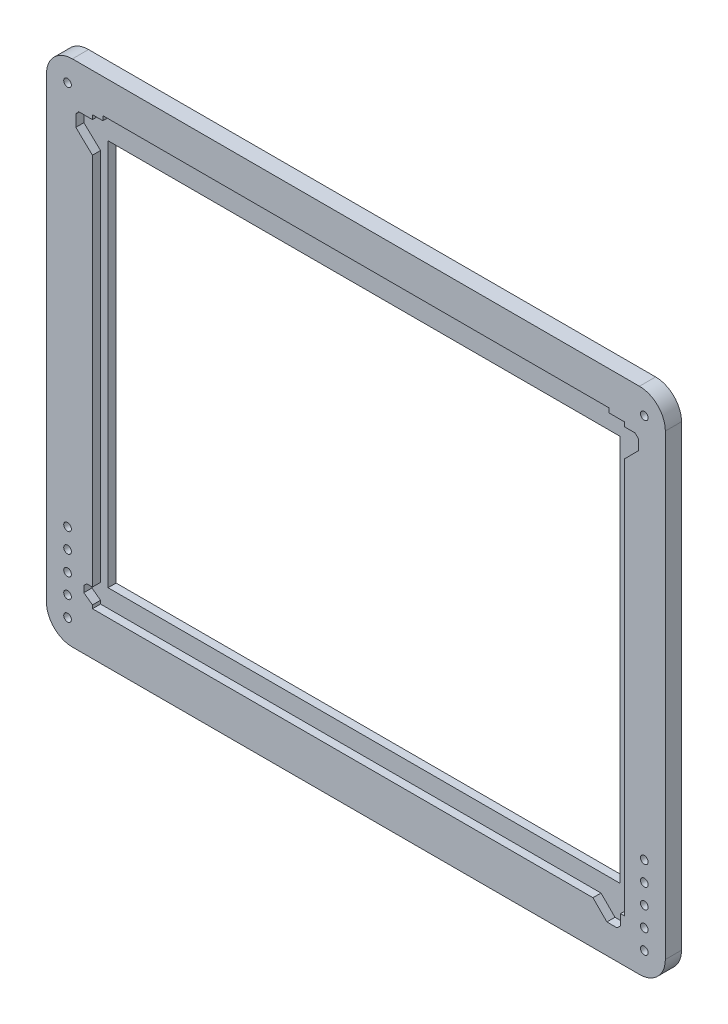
ISO-10303-21;
HEADER;
FILE_DESCRIPTION(('STEP AP214'),'2;1');
FILE_NAME('part.step','',(''),(''),'','','');
FILE_SCHEMA(('AUTOMOTIVE_DESIGN { 1 0 10303 214 1 1 1 1 }'));
ENDSEC;
DATA;
#1=APPLICATION_CONTEXT('core data for automotive mechanical design processes');
#2=APPLICATION_PROTOCOL_DEFINITION('international standard','automotive_design',2000,#1);
#3=PRODUCT_CONTEXT('',#1,'mechanical');
#4=PRODUCT('Part','Part','',(#3));
#5=PRODUCT_RELATED_PRODUCT_CATEGORY('part','',(#4));
#6=PRODUCT_DEFINITION_FORMATION('','',#4);
#7=PRODUCT_DEFINITION_CONTEXT('part definition',#1,'design');
#8=PRODUCT_DEFINITION('design','',#6,#7);
#9=PRODUCT_DEFINITION_SHAPE('','',#8);
#10=(LENGTH_UNIT() NAMED_UNIT(*) SI_UNIT(.MILLI.,.METRE.));
#11=(NAMED_UNIT(*) PLANE_ANGLE_UNIT() SI_UNIT($,.RADIAN.));
#12=(NAMED_UNIT(*) SI_UNIT($,.STERADIAN.) SOLID_ANGLE_UNIT());
#13=UNCERTAINTY_MEASURE_WITH_UNIT(LENGTH_MEASURE(1.E-05),#10,'distance_accuracy_value','');
#14=(GEOMETRIC_REPRESENTATION_CONTEXT(3) GLOBAL_UNCERTAINTY_ASSIGNED_CONTEXT((#13)) GLOBAL_UNIT_ASSIGNED_CONTEXT((#10,
#11,#12)) REPRESENTATION_CONTEXT('',''));
#15=CARTESIAN_POINT('',(0.,0.,0.));
#16=DIRECTION('',(0.,0.,1.));
#17=DIRECTION('',(1.,0.,0.));
#18=AXIS2_PLACEMENT_3D('',#15,#16,#17);
#19=CARTESIAN_POINT('',(502.852901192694,174.966376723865,3.175));
#20=DIRECTION('',(0.,1.,0.));
#21=DIRECTION('',(0.,0.,1.));
#22=AXIS2_PLACEMENT_3D('',#19,#20,#21);
#23=PLANE('',#22);
#24=DIRECTION('',(-1.,0.,0.));
#25=VECTOR('',#24,1.);
#26=CARTESIAN_POINT('',(502.852901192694,174.966376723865,6.35));
#27=LINE('',#26,#25);
#28=CARTESIAN_POINT('',(502.852901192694,174.966376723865,6.35));
#29=VERTEX_POINT('',#28);
#30=CARTESIAN_POINT('',(496.656247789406,174.966376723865,6.35));
#31=VERTEX_POINT('',#30);
#32=EDGE_CURVE('E490',#29,#31,#27,.T.);
#33=ORIENTED_EDGE('',*,*,#32,.T.);
#34=DIRECTION('',(0.,0.,-1.));
#35=VECTOR('',#34,1.);
#36=CARTESIAN_POINT('',(496.656247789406,174.966376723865,3.175));
#37=LINE('',#36,#35);
#38=CARTESIAN_POINT('',(496.656247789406,174.966376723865,3.175));
#39=VERTEX_POINT('',#38);
#40=EDGE_CURVE('E12',#31,#39,#37,.T.);
#41=ORIENTED_EDGE('',*,*,#40,.T.);
#42=DIRECTION('',(-1.,0.,0.));
#43=VECTOR('',#42,1.);
#44=CARTESIAN_POINT('',(502.852901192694,174.966376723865,3.175));
#45=LINE('',#44,#43);
#46=CARTESIAN_POINT('',(502.852901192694,174.966376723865,3.175));
#47=VERTEX_POINT('',#46);
#48=EDGE_CURVE('E311',#47,#39,#45,.T.);
#49=ORIENTED_EDGE('',*,*,#48,.F.);
#50=DIRECTION('',(0.,0.,1.));
#51=VECTOR('',#50,1.);
#52=CARTESIAN_POINT('',(502.852901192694,174.966376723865,3.175));
#53=LINE('',#52,#51);
#54=EDGE_CURVE('E488',#47,#29,#53,.T.);
#55=ORIENTED_EDGE('',*,*,#54,.T.);
#56=EDGE_LOOP('',(#33,#41,#49,#55));
#57=FACE_BOUND('',#56,.T.);
#58=ADVANCED_FACE('F47',(#57),#23,.F.);
#59=CARTESIAN_POINT('',(296.803266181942,14.00175,0.));
#60=DIRECTION('',(-1.,0.,0.));
#61=DIRECTION('',(0.,0.,1.));
#62=AXIS2_PLACEMENT_3D('',#59,#60,#61);
#63=PLANE('',#62);
#64=DIRECTION('',(0.,1.,0.));
#65=VECTOR('',#64,1.);
#66=CARTESIAN_POINT('',(296.803266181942,14.00175,3.175));
#67=LINE('',#66,#65);
#68=CARTESIAN_POINT('',(296.803266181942,14.00175,3.175));
#69=VERTEX_POINT('',#68);
#70=CARTESIAN_POINT('',(296.803266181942,166.00043,3.175));
#71=VERTEX_POINT('',#70);
#72=EDGE_CURVE('E1365',#69,#71,#67,.T.);
#73=ORIENTED_EDGE('',*,*,#72,.F.);
#74=DIRECTION('',(0.,0.,1.));
#75=VECTOR('',#74,1.);
#76=CARTESIAN_POINT('',(296.803266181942,14.00175,0.));
#77=LINE('',#76,#75);
#78=CARTESIAN_POINT('',(296.803266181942,14.00175,0.));
#79=VERTEX_POINT('',#78);
#80=EDGE_CURVE('E1350',#79,#69,#77,.T.);
#81=ORIENTED_EDGE('',*,*,#80,.F.);
#82=DIRECTION('',(0.,-1.,0.));
#83=VECTOR('',#82,1.);
#84=CARTESIAN_POINT('',(296.803266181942,14.00175,0.));
#85=LINE('',#84,#83);
#86=CARTESIAN_POINT('',(296.803266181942,166.00043,0.));
#87=VERTEX_POINT('',#86);
#88=EDGE_CURVE('E1347',#87,#79,#85,.T.);
#89=ORIENTED_EDGE('',*,*,#88,.F.);
#90=DIRECTION('',(0.,0.,1.));
#91=VECTOR('',#90,1.);
#92=CARTESIAN_POINT('',(296.803266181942,166.00043,0.));
#93=LINE('',#92,#91);
#94=EDGE_CURVE('E1235',#87,#71,#93,.T.);
#95=ORIENTED_EDGE('',*,*,#94,.T.);
#96=EDGE_LOOP('',(#73,#81,#89,#95));
#97=FACE_BOUND('',#96,.T.);
#98=ADVANCED_FACE('F769',(#97),#63,.F.);
#99=CARTESIAN_POINT('',(296.803266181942,166.00043,0.));
#100=DIRECTION('',(0.,1.,0.));
#101=DIRECTION('',(0.,0.,1.));
#102=AXIS2_PLACEMENT_3D('',#99,#100,#101);
#103=PLANE('',#102);
#104=DIRECTION('',(1.,0.,0.));
#105=VECTOR('',#104,1.);
#106=CARTESIAN_POINT('',(296.803266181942,166.00043,3.175));
#107=LINE('',#106,#105);
#108=CARTESIAN_POINT('',(497.803626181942,166.00043,3.175));
#109=VERTEX_POINT('',#108);
#110=EDGE_CURVE('E528',#71,#109,#107,.T.);
#111=ORIENTED_EDGE('',*,*,#110,.F.);
#112=ORIENTED_EDGE('',*,*,#94,.F.);
#113=DIRECTION('',(-1.,0.,0.));
#114=VECTOR('',#113,1.);
#115=CARTESIAN_POINT('',(296.803266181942,166.00043,0.));
#116=LINE('',#115,#114);
#117=CARTESIAN_POINT('',(497.803626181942,166.00043,0.));
#118=VERTEX_POINT('',#117);
#119=EDGE_CURVE('E1344',#118,#87,#116,.T.);
#120=ORIENTED_EDGE('',*,*,#119,.F.);
#121=DIRECTION('',(0.,0.,1.));
#122=VECTOR('',#121,1.);
#123=CARTESIAN_POINT('',(497.803626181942,166.00043,0.));
#124=LINE('',#123,#122);
#125=EDGE_CURVE('E1240',#118,#109,#124,.T.);
#126=ORIENTED_EDGE('',*,*,#125,.T.);
#127=EDGE_LOOP('',(#111,#112,#120,#126));
#128=FACE_BOUND('',#127,.T.);
#129=ADVANCED_FACE('F775',(#128),#103,.F.);
#130=CARTESIAN_POINT('',(497.803626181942,166.00043,0.));
#131=DIRECTION('',(1.,0.,0.));
#132=DIRECTION('',(0.,0.,-1.));
#133=AXIS2_PLACEMENT_3D('',#130,#131,#132);
#134=PLANE('',#133);
#135=DIRECTION('',(0.,-1.,0.));
#136=VECTOR('',#135,1.);
#137=CARTESIAN_POINT('',(497.803626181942,166.00043,3.175));
#138=LINE('',#137,#136);
#139=CARTESIAN_POINT('',(497.803626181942,14.00175,3.175));
#140=VERTEX_POINT('',#139);
#141=EDGE_CURVE('E526',#109,#140,#138,.T.);
#142=ORIENTED_EDGE('',*,*,#141,.F.);
#143=ORIENTED_EDGE('',*,*,#125,.F.);
#144=DIRECTION('',(0.,1.,0.));
#145=VECTOR('',#144,1.);
#146=CARTESIAN_POINT('',(497.803626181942,166.00043,0.));
#147=LINE('',#146,#145);
#148=CARTESIAN_POINT('',(497.803626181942,14.00175,0.));
#149=VERTEX_POINT('',#148);
#150=EDGE_CURVE('E1348',#149,#118,#147,.T.);
#151=ORIENTED_EDGE('',*,*,#150,.F.);
#152=DIRECTION('',(0.,0.,1.));
#153=VECTOR('',#152,1.);
#154=CARTESIAN_POINT('',(497.803626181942,14.00175,0.));
#155=LINE('',#154,#153);
#156=EDGE_CURVE('E1352',#149,#140,#155,.T.);
#157=ORIENTED_EDGE('',*,*,#156,.T.);
#158=EDGE_LOOP('',(#142,#143,#151,#157));
#159=FACE_BOUND('',#158,.T.);
#160=ADVANCED_FACE('F1117',(#159),#134,.F.);
#161=CARTESIAN_POINT('',(497.803626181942,14.00175,0.));
#162=DIRECTION('',(0.,-1.,0.));
#163=DIRECTION('',(0.,0.,-1.));
#164=AXIS2_PLACEMENT_3D('',#161,#162,#163);
#165=PLANE('',#164);
#166=DIRECTION('',(-1.,0.,0.));
#167=VECTOR('',#166,1.);
#168=CARTESIAN_POINT('',(497.803626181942,14.00175,3.175));
#169=LINE('',#168,#167);
#170=EDGE_CURVE('E539',#140,#69,#169,.T.);
#171=ORIENTED_EDGE('',*,*,#170,.F.);
#172=ORIENTED_EDGE('',*,*,#156,.F.);
#173=DIRECTION('',(1.,0.,0.));
#174=VECTOR('',#173,1.);
#175=CARTESIAN_POINT('',(497.803626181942,14.00175,0.));
#176=LINE('',#175,#174);
#177=EDGE_CURVE('E1353',#79,#149,#176,.T.);
#178=ORIENTED_EDGE('',*,*,#177,.F.);
#179=ORIENTED_EDGE('',*,*,#80,.T.);
#180=EDGE_LOOP('',(#171,#172,#178,#179));
#181=FACE_BOUND('',#180,.T.);
#182=ADVANCED_FACE('F1112',(#181),#165,.F.);
#183=CARTESIAN_POINT('',(0.,190.015000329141,6.35));
#184=DIRECTION('',(0.,1.,0.));
#185=DIRECTION('',(0.,0.,1.));
#186=AXIS2_PLACEMENT_3D('',#183,#184,#185);
#187=PLANE('',#186);
#188=DIRECTION('',(1.,0.,0.));
#189=VECTOR('',#188,1.);
#190=CARTESIAN_POINT('',(0.,190.015000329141,0.));
#191=LINE('',#190,#189);
#192=CARTESIAN_POINT('',(285.971860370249,190.015000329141,0.));
#193=VERTEX_POINT('',#192);
#194=CARTESIAN_POINT('',(508.635031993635,190.015000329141,0.));
#195=VERTEX_POINT('',#194);
#196=EDGE_CURVE('E1226',#193,#195,#191,.T.);
#197=ORIENTED_EDGE('',*,*,#196,.F.);
#198=DIRECTION('',(0.,0.,-1.));
#199=VECTOR('',#198,1.);
#200=CARTESIAN_POINT('',(285.971860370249,190.015000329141,6.35));
#201=LINE('',#200,#199);
#202=CARTESIAN_POINT('',(285.971860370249,190.015000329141,6.35));
#203=VERTEX_POINT('',#202);
#204=EDGE_CURVE('E542',#203,#193,#201,.T.);
#205=ORIENTED_EDGE('',*,*,#204,.F.);
#206=DIRECTION('',(1.,0.,0.));
#207=VECTOR('',#206,1.);
#208=CARTESIAN_POINT('',(0.,190.015000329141,6.35));
#209=LINE('',#208,#207);
#210=CARTESIAN_POINT('',(508.635031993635,190.015000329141,6.35));
#211=VERTEX_POINT('',#210);
#212=EDGE_CURVE('E1259',#203,#211,#209,.T.);
#213=ORIENTED_EDGE('',*,*,#212,.T.);
#214=DIRECTION('',(0.,0.,-1.));
#215=VECTOR('',#214,1.);
#216=CARTESIAN_POINT('',(508.635031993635,190.015000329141,6.35));
#217=LINE('',#216,#215);
#218=EDGE_CURVE('E1229',#211,#195,#217,.T.);
#219=ORIENTED_EDGE('',*,*,#218,.T.);
#220=EDGE_LOOP('',(#197,#205,#213,#219));
#221=FACE_BOUND('',#220,.T.);
#222=ADVANCED_FACE('F49',(#221),#187,.T.);
#223=CARTESIAN_POINT('',(285.971860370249,179.855000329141,6.35));
#224=DIRECTION('',(0.,0.,-1.));
#225=DIRECTION('',(-1.,0.,0.));
#226=AXIS2_PLACEMENT_3D('',#223,#224,#225);
#227=CYLINDRICAL_SURFACE('',#226,10.16);
#228=CARTESIAN_POINT('',(285.971860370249,179.855000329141,0.));
#229=DIRECTION('',(0.,0.,1.));
#230=DIRECTION('',(1.,0.,0.));
#231=AXIS2_PLACEMENT_3D('',#228,#229,#230);
#232=CIRCLE('',#231,10.16);
#233=CARTESIAN_POINT('',(275.811860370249,179.855000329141,0.));
#234=VERTEX_POINT('',#233);
#235=EDGE_CURVE('E1234',#193,#234,#232,.T.);
#236=ORIENTED_EDGE('',*,*,#235,.T.);
#237=DIRECTION('',(0.,0.,-1.));
#238=VECTOR('',#237,1.);
#239=CARTESIAN_POINT('',(275.811860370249,179.855000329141,6.35));
#240=LINE('',#239,#238);
#241=CARTESIAN_POINT('',(275.811860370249,179.855000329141,6.35));
#242=VERTEX_POINT('',#241);
#243=EDGE_CURVE('E1273',#242,#234,#240,.T.);
#244=ORIENTED_EDGE('',*,*,#243,.F.);
#245=CARTESIAN_POINT('',(285.971860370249,179.855000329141,6.35));
#246=DIRECTION('',(0.,0.,1.));
#247=DIRECTION('',(1.,0.,0.));
#248=AXIS2_PLACEMENT_3D('',#245,#246,#247);
#249=CIRCLE('',#248,10.16);
#250=EDGE_CURVE('E1283',#203,#242,#249,.T.);
#251=ORIENTED_EDGE('',*,*,#250,.F.);
#252=ORIENTED_EDGE('',*,*,#204,.T.);
#253=EDGE_LOOP('',(#236,#244,#251,#252));
#254=FACE_BOUND('',#253,.T.);
#255=ADVANCED_FACE('F1204',(#254),#227,.T.);
#256=CARTESIAN_POINT('',(275.811860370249,0.,6.35));
#257=DIRECTION('',(1.,0.,0.));
#258=DIRECTION('',(0.,0.,-1.));
#259=AXIS2_PLACEMENT_3D('',#256,#257,#258);
#260=PLANE('',#259);
#261=DIRECTION('',(0.,-1.,0.));
#262=VECTOR('',#261,1.);
#263=CARTESIAN_POINT('',(275.811860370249,0.,0.));
#264=LINE('',#263,#262);
#265=CARTESIAN_POINT('',(275.811860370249,0.147179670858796,0.));
#266=VERTEX_POINT('',#265);
#267=EDGE_CURVE('E1237',#234,#266,#264,.T.);
#268=ORIENTED_EDGE('',*,*,#267,.T.);
#269=DIRECTION('',(0.,0.,-1.));
#270=VECTOR('',#269,1.);
#271=CARTESIAN_POINT('',(275.811860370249,0.147179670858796,6.35));
#272=LINE('',#271,#270);
#273=CARTESIAN_POINT('',(275.811860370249,0.147179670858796,6.35));
#274=VERTEX_POINT('',#273);
#275=EDGE_CURVE('E1271',#274,#266,#272,.T.);
#276=ORIENTED_EDGE('',*,*,#275,.F.);
#277=DIRECTION('',(0.,-1.,0.));
#278=VECTOR('',#277,1.);
#279=CARTESIAN_POINT('',(275.811860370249,0.,6.35));
#280=LINE('',#279,#278);
#281=EDGE_CURVE('E1286',#242,#274,#280,.T.);
#282=ORIENTED_EDGE('',*,*,#281,.F.);
#283=ORIENTED_EDGE('',*,*,#243,.T.);
#284=EDGE_LOOP('',(#268,#276,#282,#283));
#285=FACE_BOUND('',#284,.T.);
#286=ADVANCED_FACE('F1194',(#285),#260,.F.);
#287=CARTESIAN_POINT('',(285.971860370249,0.147179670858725,6.35));
#288=DIRECTION('',(0.,0.,-1.));
#289=DIRECTION('',(-1.,0.,0.));
#290=AXIS2_PLACEMENT_3D('',#287,#288,#289);
#291=CYLINDRICAL_SURFACE('',#290,10.16);
#292=CARTESIAN_POINT('',(285.971860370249,0.147179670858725,0.));
#293=DIRECTION('',(0.,0.,1.));
#294=DIRECTION('',(1.,0.,0.));
#295=AXIS2_PLACEMENT_3D('',#292,#293,#294);
#296=CIRCLE('',#295,10.16);
#297=CARTESIAN_POINT('',(285.971860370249,-10.0128203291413,0.));
#298=VERTEX_POINT('',#297);
#299=EDGE_CURVE('E1247',#266,#298,#296,.T.);
#300=ORIENTED_EDGE('',*,*,#299,.T.);
#301=DIRECTION('',(0.,0.,-1.));
#302=VECTOR('',#301,1.);
#303=CARTESIAN_POINT('',(285.971860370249,-10.0128203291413,6.35));
#304=LINE('',#303,#302);
#305=CARTESIAN_POINT('',(285.971860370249,-10.0128203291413,6.35));
#306=VERTEX_POINT('',#305);
#307=EDGE_CURVE('E1268',#306,#298,#304,.T.);
#308=ORIENTED_EDGE('',*,*,#307,.F.);
#309=CARTESIAN_POINT('',(285.971860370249,0.147179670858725,6.35));
#310=DIRECTION('',(0.,0.,1.));
#311=DIRECTION('',(1.,0.,0.));
#312=AXIS2_PLACEMENT_3D('',#309,#310,#311);
#313=CIRCLE('',#312,10.16);
#314=EDGE_CURVE('E1291',#274,#306,#313,.T.);
#315=ORIENTED_EDGE('',*,*,#314,.F.);
#316=ORIENTED_EDGE('',*,*,#275,.T.);
#317=EDGE_LOOP('',(#300,#308,#315,#316));
#318=FACE_BOUND('',#317,.T.);
#319=ADVANCED_FACE('F1184',(#318),#291,.T.);
#320=CARTESIAN_POINT('',(0.,-10.0128203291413,6.35));
#321=DIRECTION('',(0.,1.,0.));
#322=DIRECTION('',(0.,0.,1.));
#323=AXIS2_PLACEMENT_3D('',#320,#321,#322);
#324=PLANE('',#323);
#325=DIRECTION('',(1.,0.,0.));
#326=VECTOR('',#325,1.);
#327=CARTESIAN_POINT('',(0.,-10.0128203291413,0.));
#328=LINE('',#327,#326);
#329=CARTESIAN_POINT('',(508.635031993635,-10.0128203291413,0.));
#330=VERTEX_POINT('',#329);
#331=EDGE_CURVE('E1249',#298,#330,#328,.T.);
#332=ORIENTED_EDGE('',*,*,#331,.T.);
#333=DIRECTION('',(0.,0.,-1.));
#334=VECTOR('',#333,1.);
#335=CARTESIAN_POINT('',(508.635031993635,-10.0128203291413,6.35));
#336=LINE('',#335,#334);
#337=CARTESIAN_POINT('',(508.635031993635,-10.0128203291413,6.35));
#338=VERTEX_POINT('',#337);
#339=EDGE_CURVE('E1265',#338,#330,#336,.T.);
#340=ORIENTED_EDGE('',*,*,#339,.F.);
#341=DIRECTION('',(1.,0.,0.));
#342=VECTOR('',#341,1.);
#343=CARTESIAN_POINT('',(0.,-10.0128203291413,6.35));
#344=LINE('',#343,#342);
#345=EDGE_CURVE('E1293',#306,#338,#344,.T.);
#346=ORIENTED_EDGE('',*,*,#345,.F.);
#347=ORIENTED_EDGE('',*,*,#307,.T.);
#348=EDGE_LOOP('',(#332,#340,#346,#347));
#349=FACE_BOUND('',#348,.T.);
#350=ADVANCED_FACE('F1174',(#349),#324,.F.);
#351=CARTESIAN_POINT('',(508.635031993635,0.147179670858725,6.35));
#352=DIRECTION('',(0.,0.,-1.));
#353=DIRECTION('',(-1.,0.,0.));
#354=AXIS2_PLACEMENT_3D('',#351,#352,#353);
#355=CYLINDRICAL_SURFACE('',#354,10.16);
#356=CARTESIAN_POINT('',(508.635031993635,0.147179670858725,0.));
#357=DIRECTION('',(0.,0.,1.));
#358=DIRECTION('',(1.,0.,0.));
#359=AXIS2_PLACEMENT_3D('',#356,#357,#358);
#360=CIRCLE('',#359,10.16);
#361=CARTESIAN_POINT('',(518.795031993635,0.147179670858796,0.));
#362=VERTEX_POINT('',#361);
#363=EDGE_CURVE('E1251',#330,#362,#360,.T.);
#364=ORIENTED_EDGE('',*,*,#363,.T.);
#365=DIRECTION('',(0.,0.,-1.));
#366=VECTOR('',#365,1.);
#367=CARTESIAN_POINT('',(518.795031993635,0.147179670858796,6.35));
#368=LINE('',#367,#366);
#369=CARTESIAN_POINT('',(518.795031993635,0.147179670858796,6.35));
#370=VERTEX_POINT('',#369);
#371=EDGE_CURVE('E1263',#370,#362,#368,.T.);
#372=ORIENTED_EDGE('',*,*,#371,.F.);
#373=CARTESIAN_POINT('',(508.635031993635,0.147179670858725,6.35));
#374=DIRECTION('',(0.,0.,1.));
#375=DIRECTION('',(1.,0.,0.));
#376=AXIS2_PLACEMENT_3D('',#373,#374,#375);
#377=CIRCLE('',#376,10.16);
#378=EDGE_CURVE('E1297',#338,#370,#377,.T.);
#379=ORIENTED_EDGE('',*,*,#378,.F.);
#380=ORIENTED_EDGE('',*,*,#339,.T.);
#381=EDGE_LOOP('',(#364,#372,#379,#380));
#382=FACE_BOUND('',#381,.T.);
#383=ADVANCED_FACE('F1164',(#382),#355,.T.);
#384=CARTESIAN_POINT('',(518.795031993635,0.,6.35));
#385=DIRECTION('',(1.,0.,0.));
#386=DIRECTION('',(0.,0.,-1.));
#387=AXIS2_PLACEMENT_3D('',#384,#385,#386);
#388=PLANE('',#387);
#389=DIRECTION('',(0.,-1.,0.));
#390=VECTOR('',#389,1.);
#391=CARTESIAN_POINT('',(518.795031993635,0.,0.));
#392=LINE('',#391,#390);
#393=CARTESIAN_POINT('',(518.795031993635,179.855000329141,0.));
#394=VERTEX_POINT('',#393);
#395=EDGE_CURVE('E1254',#394,#362,#392,.T.);
#396=ORIENTED_EDGE('',*,*,#395,.F.);
#397=DIRECTION('',(0.,0.,-1.));
#398=VECTOR('',#397,1.);
#399=CARTESIAN_POINT('',(518.795031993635,179.855000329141,6.35));
#400=LINE('',#399,#398);
#401=CARTESIAN_POINT('',(518.795031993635,179.855000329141,6.35));
#402=VERTEX_POINT('',#401);
#403=EDGE_CURVE('E1261',#402,#394,#400,.T.);
#404=ORIENTED_EDGE('',*,*,#403,.F.);
#405=DIRECTION('',(0.,-1.,0.));
#406=VECTOR('',#405,1.);
#407=CARTESIAN_POINT('',(518.795031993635,0.,6.35));
#408=LINE('',#407,#406);
#409=EDGE_CURVE('E1298',#402,#370,#408,.T.);
#410=ORIENTED_EDGE('',*,*,#409,.T.);
#411=ORIENTED_EDGE('',*,*,#371,.T.);
#412=EDGE_LOOP('',(#396,#404,#410,#411));
#413=FACE_BOUND('',#412,.T.);
#414=ADVANCED_FACE('F1152',(#413),#388,.T.);
#415=CARTESIAN_POINT('',(508.635031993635,179.855000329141,6.35));
#416=DIRECTION('',(0.,0.,-1.));
#417=DIRECTION('',(-1.,0.,0.));
#418=AXIS2_PLACEMENT_3D('',#415,#416,#417);
#419=CYLINDRICAL_SURFACE('',#418,10.16);
#420=CARTESIAN_POINT('',(508.635031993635,179.855000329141,0.));
#421=DIRECTION('',(0.,0.,1.));
#422=DIRECTION('',(1.,0.,0.));
#423=AXIS2_PLACEMENT_3D('',#420,#421,#422);
#424=CIRCLE('',#423,10.16);
#425=EDGE_CURVE('E1257',#195,#394,#424,.F.);
#426=ORIENTED_EDGE('',*,*,#425,.F.);
#427=ORIENTED_EDGE('',*,*,#218,.F.);
#428=CARTESIAN_POINT('',(508.635031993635,179.855000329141,6.35));
#429=DIRECTION('',(0.,0.,1.));
#430=DIRECTION('',(1.,0.,0.));
#431=AXIS2_PLACEMENT_3D('',#428,#429,#430);
#432=CIRCLE('',#431,10.16);
#433=EDGE_CURVE('E1243',#211,#402,#432,.F.);
#434=ORIENTED_EDGE('',*,*,#433,.T.);
#435=ORIENTED_EDGE('',*,*,#403,.T.);
#436=EDGE_LOOP('',(#426,#427,#434,#435));
#437=FACE_BOUND('',#436,.T.);
#438=ADVANCED_FACE('F1147',(#437),#419,.T.);
#439=CARTESIAN_POINT('',(0.,0.,6.35));
#440=DIRECTION('',(0.,0.,1.));
#441=DIRECTION('',(1.,0.,0.));
#442=AXIS2_PLACEMENT_3D('',#439,#440,#441);
#443=PLANE('',#442);
#444=DIRECTION('',(0.,1.,0.));
#445=VECTOR('',#444,1.);
#446=CARTESIAN_POINT('',(496.656247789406,176.697205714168,6.35));
#447=LINE('',#446,#445);
#448=CARTESIAN_POINT('',(496.656247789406,176.697205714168,6.35));
#449=VERTEX_POINT('',#448);
#450=EDGE_CURVE('E319',#31,#449,#447,.T.);
#451=ORIENTED_EDGE('',*,*,#450,.F.);
#452=ORIENTED_EDGE('',*,*,#32,.F.);
#453=DIRECTION('',(0.,1.,0.));
#454=VECTOR('',#453,1.);
#455=CARTESIAN_POINT('',(502.852901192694,173.289969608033,6.35));
#456=LINE('',#455,#454);
#457=CARTESIAN_POINT('',(502.852901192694,173.289969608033,6.35));
#458=VERTEX_POINT('',#457);
#459=EDGE_CURVE('E70',#458,#29,#456,.T.);
#460=ORIENTED_EDGE('',*,*,#459,.F.);
#461=DIRECTION('',(-1.,0.,0.));
#462=VECTOR('',#461,1.);
#463=CARTESIAN_POINT('',(502.852901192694,173.289969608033,6.35));
#464=LINE('',#463,#462);
#465=CARTESIAN_POINT('',(506.850861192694,173.289969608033,6.35));
#466=VERTEX_POINT('',#465);
#467=EDGE_CURVE('E421',#466,#458,#464,.T.);
#468=ORIENTED_EDGE('',*,*,#467,.F.);
#469=DIRECTION('',(-0.736776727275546,0.676136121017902,0.));
#470=VECTOR('',#469,1.);
#471=CARTESIAN_POINT('',(506.850861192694,173.289969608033,6.35));
#472=LINE('',#471,#470);
#473=CARTESIAN_POINT('',(508.292879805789,171.966636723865,6.35));
#474=VERTEX_POINT('',#473);
#475=EDGE_CURVE('E701',#474,#466,#472,.T.);
#476=ORIENTED_EDGE('',*,*,#475,.F.);
#477=DIRECTION('',(0.,1.,0.));
#478=VECTOR('',#477,1.);
#479=CARTESIAN_POINT('',(508.292879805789,171.966636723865,6.35));
#480=LINE('',#479,#478);
#481=CARTESIAN_POINT('',(508.292879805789,167.966136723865,6.35));
#482=VERTEX_POINT('',#481);
#483=EDGE_CURVE('E694',#482,#474,#480,.T.);
#484=ORIENTED_EDGE('',*,*,#483,.F.);
#485=DIRECTION('',(0.703517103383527,0.710678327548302,0.));
#486=VECTOR('',#485,1.);
#487=CARTESIAN_POINT('',(508.292879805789,167.966136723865,6.35));
#488=LINE('',#487,#486);
#489=CARTESIAN_POINT('',(502.852901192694,162.470783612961,6.35));
#490=VERTEX_POINT('',#489);
#491=EDGE_CURVE('E748',#490,#482,#488,.T.);
#492=ORIENTED_EDGE('',*,*,#491,.F.);
#493=DIRECTION('',(0.,1.,0.));
#494=VECTOR('',#493,1.);
#495=CARTESIAN_POINT('',(502.852901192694,6.96569672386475,6.35));
#496=LINE('',#495,#494);
#497=CARTESIAN_POINT('',(502.852901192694,6.96569672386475,6.35));
#498=VERTEX_POINT('',#497);
#499=EDGE_CURVE('E679',#498,#490,#496,.T.);
#500=ORIENTED_EDGE('',*,*,#499,.F.);
#501=DIRECTION('',(1.,0.,0.));
#502=VECTOR('',#501,1.);
#503=CARTESIAN_POINT('',(501.217591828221,6.96569672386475,6.35));
#504=LINE('',#503,#502);
#505=CARTESIAN_POINT('',(501.217591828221,6.96569672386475,6.35));
#506=VERTEX_POINT('',#505);
#507=EDGE_CURVE('E671',#506,#498,#504,.T.);
#508=ORIENTED_EDGE('',*,*,#507,.F.);
#509=DIRECTION('',(0.,1.,0.));
#510=VECTOR('',#509,1.);
#511=CARTESIAN_POINT('',(501.217591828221,2.81167510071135,6.35));
#512=LINE('',#511,#510);
#513=CARTESIAN_POINT('',(501.217591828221,2.81167510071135,6.35));
#514=VERTEX_POINT('',#513);
#515=EDGE_CURVE('E744',#514,#506,#512,.T.);
#516=ORIENTED_EDGE('',*,*,#515,.F.);
#517=DIRECTION('',(0.709360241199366,0.704846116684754,0.));
#518=VECTOR('',#517,1.);
#519=CARTESIAN_POINT('',(499.853161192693,1.45592723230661,6.35));
#520=LINE('',#519,#518);
#521=CARTESIAN_POINT('',(499.853161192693,1.45592723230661,6.35));
#522=VERTEX_POINT('',#521);
#523=EDGE_CURVE('E657',#522,#514,#520,.T.);
#524=ORIENTED_EDGE('',*,*,#523,.F.);
#525=DIRECTION('',(1.,0.,0.));
#526=VECTOR('',#525,1.);
#527=CARTESIAN_POINT('',(495.852661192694,1.45592723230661,6.35));
#528=LINE('',#527,#526);
#529=CARTESIAN_POINT('',(495.852661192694,1.45592723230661,6.35));
#530=VERTEX_POINT('',#529);
#531=EDGE_CURVE('E649',#530,#522,#528,.T.);
#532=ORIENTED_EDGE('',*,*,#531,.F.);
#533=DIRECTION('',(0.704846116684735,-0.709360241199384,0.));
#534=VECTOR('',#533,1.);
#535=CARTESIAN_POINT('',(490.377953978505,6.96569672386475,6.35));
#536=LINE('',#535,#534);
#537=CARTESIAN_POINT('',(490.377953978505,6.96569672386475,6.35));
#538=VERTEX_POINT('',#537);
#539=EDGE_CURVE('E740',#538,#530,#536,.T.);
#540=ORIENTED_EDGE('',*,*,#539,.F.);
#541=DIRECTION('',(1.,0.,0.));
#542=VECTOR('',#541,1.);
#543=CARTESIAN_POINT('',(293.851541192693,6.96569672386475,6.35));
#544=LINE('',#543,#542);
#545=CARTESIAN_POINT('',(293.851541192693,6.96569672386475,6.35));
#546=VERTEX_POINT('',#545);
#547=EDGE_CURVE('E635',#546,#538,#544,.T.);
#548=ORIENTED_EDGE('',*,*,#547,.F.);
#549=DIRECTION('',(0.,-1.,0.));
#550=VECTOR('',#549,1.);
#551=CARTESIAN_POINT('',(293.851541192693,8.27399892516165,6.35));
#552=LINE('',#551,#550);
#553=CARTESIAN_POINT('',(293.851541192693,8.27399892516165,6.35));
#554=VERTEX_POINT('',#553);
#555=EDGE_CURVE('E627',#554,#546,#552,.T.);
#556=ORIENTED_EDGE('',*,*,#555,.F.);
#557=DIRECTION('',(0.809290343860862,-0.587408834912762,0.));
#558=VECTOR('',#557,1.);
#559=CARTESIAN_POINT('',(290.46502697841,10.7320393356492,6.35));
#560=LINE('',#559,#558);
#561=CARTESIAN_POINT('',(290.46502697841,10.7320393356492,6.35));
#562=VERTEX_POINT('',#561);
#563=EDGE_CURVE('E732',#562,#554,#560,.T.);
#564=ORIENTED_EDGE('',*,*,#563,.F.);
#565=DIRECTION('',(0.,-1.,0.));
#566=VECTOR('',#565,1.);
#567=CARTESIAN_POINT('',(290.46502697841,13.1900797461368,6.35));
#568=LINE('',#567,#566);
#569=CARTESIAN_POINT('',(290.46502697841,13.1900797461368,6.35));
#570=VERTEX_POINT('',#569);
#571=EDGE_CURVE('E613',#570,#562,#568,.T.);
#572=ORIENTED_EDGE('',*,*,#571,.F.);
#573=DIRECTION('',(-0.697354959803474,-0.716725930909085,0.));
#574=VECTOR('',#573,1.);
#575=CARTESIAN_POINT('',(291.585146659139,14.3413138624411,6.35));
#576=LINE('',#575,#574);
#577=CARTESIAN_POINT('',(291.585146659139,14.3413138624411,6.35));
#578=VERTEX_POINT('',#577);
#579=EDGE_CURVE('E605',#578,#570,#576,.T.);
#580=ORIENTED_EDGE('',*,*,#579,.F.);
#581=DIRECTION('',(-1.,0.,0.));
#582=VECTOR('',#581,1.);
#583=CARTESIAN_POINT('',(293.851541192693,14.3413138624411,6.35));
#584=LINE('',#583,#582);
#585=CARTESIAN_POINT('',(293.851541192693,14.3413138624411,6.35));
#586=VERTEX_POINT('',#585);
#587=EDGE_CURVE('E723',#586,#578,#584,.T.);
#588=ORIENTED_EDGE('',*,*,#587,.F.);
#589=DIRECTION('',(0.,-1.,0.));
#590=VECTOR('',#589,1.);
#591=CARTESIAN_POINT('',(293.851541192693,161.208119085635,6.35));
#592=LINE('',#591,#590);
#593=CARTESIAN_POINT('',(293.851541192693,161.208119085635,6.35));
#594=VERTEX_POINT('',#593);
#595=EDGE_CURVE('E591',#594,#586,#592,.T.);
#596=ORIENTED_EDGE('',*,*,#595,.F.);
#597=DIRECTION('',(0.725667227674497,-0.688045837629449,0.));
#598=VECTOR('',#597,1.);
#599=CARTESIAN_POINT('',(287.31646671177,167.404390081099,6.35));
#600=LINE('',#599,#598);
#601=CARTESIAN_POINT('',(287.31646671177,167.404390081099,6.35));
#602=VERTEX_POINT('',#601);
#603=EDGE_CURVE('E583',#602,#594,#600,.T.);
#604=ORIENTED_EDGE('',*,*,#603,.F.);
#605=DIRECTION('',(0.,-1.,0.));
#606=VECTOR('',#605,1.);
#607=CARTESIAN_POINT('',(287.31646671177,167.966136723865,6.35));
#608=LINE('',#607,#606);
#609=CARTESIAN_POINT('',(287.31646671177,171.966636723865,6.35));
#610=VERTEX_POINT('',#609);
#611=EDGE_CURVE('E1436',#610,#602,#608,.T.);
#612=ORIENTED_EDGE('',*,*,#611,.F.);
#613=DIRECTION('',(-0.64986635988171,-0.760048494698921,0.));
#614=VECTOR('',#613,1.);
#615=CARTESIAN_POINT('',(288.447959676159,173.289969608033,6.35));
#616=LINE('',#615,#614);
#617=CARTESIAN_POINT('',(288.447959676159,173.289969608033,6.35));
#618=VERTEX_POINT('',#617);
#619=EDGE_CURVE('E502',#618,#610,#616,.T.);
#620=ORIENTED_EDGE('',*,*,#619,.F.);
#621=DIRECTION('',(-1.,0.,0.));
#622=VECTOR('',#621,1.);
#623=CARTESIAN_POINT('',(293.851541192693,173.289969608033,6.35));
#624=LINE('',#623,#622);
#625=CARTESIAN_POINT('',(293.851541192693,173.289969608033,6.35));
#626=VERTEX_POINT('',#625);
#627=EDGE_CURVE('E498',#626,#618,#624,.T.);
#628=ORIENTED_EDGE('',*,*,#627,.F.);
#629=DIRECTION('',(0.,-1.,0.));
#630=VECTOR('',#629,1.);
#631=CARTESIAN_POINT('',(293.851541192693,174.966376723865,6.35));
#632=LINE('',#631,#630);
#633=CARTESIAN_POINT('',(293.851541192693,174.966376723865,6.35));
#634=VERTEX_POINT('',#633);
#635=EDGE_CURVE('E495',#634,#626,#632,.T.);
#636=ORIENTED_EDGE('',*,*,#635,.F.);
#637=CARTESIAN_POINT('',(297.950644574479,174.966376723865,6.35));
#638=VERTEX_POINT('',#637);
#639=EDGE_CURVE('E489',#638,#634,#27,.T.);
#640=ORIENTED_EDGE('',*,*,#639,.F.);
#641=DIRECTION('',(0.,-1.,0.));
#642=VECTOR('',#641,1.);
#643=CARTESIAN_POINT('',(297.950644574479,176.697205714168,6.35));
#644=LINE('',#643,#642);
#645=CARTESIAN_POINT('',(297.950644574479,176.697205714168,6.35));
#646=VERTEX_POINT('',#645);
#647=EDGE_CURVE('E313',#646,#638,#644,.T.);
#648=ORIENTED_EDGE('',*,*,#647,.F.);
#649=DIRECTION('',(-1.,0.,0.));
#650=VECTOR('',#649,1.);
#651=CARTESIAN_POINT('',(297.950644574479,176.697205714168,6.35));
#652=LINE('',#651,#650);
#653=EDGE_CURVE('E330',#449,#646,#652,.T.);
#654=ORIENTED_EDGE('',*,*,#653,.F.);
#655=EDGE_LOOP('',(#451,#452,#460,#468,#476,#484,#492,#500,#508,#516,#524,#532,#540,#548,#556,
#564,#572,#580,#588,#596,#604,#612,#620,#628,#636,#640,#648,#654));
#656=FACE_BOUND('',#655,.T.);
#657=CARTESIAN_POINT('',(510.536038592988,6.79250143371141,6.35));
#658=DIRECTION('',(0.,0.,1.));
#659=DIRECTION('',(-1.,0.,0.));
#660=AXIS2_PLACEMENT_3D('',#657,#658,#659);
#661=CIRCLE('',#660,1.49999999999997);
#662=CARTESIAN_POINT('',(509.036038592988,6.79250143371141,6.35));
#663=VERTEX_POINT('',#662);
#664=EDGE_CURVE('E333',#663,#663,#661,.T.);
#665=ORIENTED_EDGE('',*,*,#664,.F.);
#666=EDGE_LOOP('',(#665));
#667=FACE_BOUND('',#666,.T.);
#668=CARTESIAN_POINT('',(510.536038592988,14.5029424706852,6.35));
#669=DIRECTION('',(0.,0.,1.));
#670=DIRECTION('',(-1.,0.,0.));
#671=AXIS2_PLACEMENT_3D('',#668,#669,#670);
#672=CIRCLE('',#671,1.49999999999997);
#673=CARTESIAN_POINT('',(509.036038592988,14.5029424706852,6.35));
#674=VERTEX_POINT('',#673);
#675=EDGE_CURVE('E338',#674,#674,#672,.T.);
#676=ORIENTED_EDGE('',*,*,#675,.F.);
#677=EDGE_LOOP('',(#676));
#678=FACE_BOUND('',#677,.T.);
#679=CARTESIAN_POINT('',(510.536038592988,22.2133835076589,6.35));
#680=DIRECTION('',(0.,0.,1.));
#681=DIRECTION('',(-1.,0.,0.));
#682=AXIS2_PLACEMENT_3D('',#679,#680,#681);
#683=CIRCLE('',#682,1.49999999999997);
#684=CARTESIAN_POINT('',(509.036038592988,22.2133835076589,6.35));
#685=VERTEX_POINT('',#684);
#686=EDGE_CURVE('E345',#685,#685,#683,.T.);
#687=ORIENTED_EDGE('',*,*,#686,.F.);
#688=EDGE_LOOP('',(#687));
#689=FACE_BOUND('',#688,.T.);
#690=CARTESIAN_POINT('',(510.536038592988,29.9238245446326,6.35));
#691=DIRECTION('',(0.,0.,1.));
#692=DIRECTION('',(-1.,0.,0.));
#693=AXIS2_PLACEMENT_3D('',#690,#691,#692);
#694=CIRCLE('',#693,1.49999999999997);
#695=CARTESIAN_POINT('',(509.036038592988,29.9238245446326,6.35));
#696=VERTEX_POINT('',#695);
#697=EDGE_CURVE('E352',#696,#696,#694,.T.);
#698=ORIENTED_EDGE('',*,*,#697,.F.);
#699=EDGE_LOOP('',(#698));
#700=FACE_BOUND('',#699,.T.);
#701=CARTESIAN_POINT('',(284.070853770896,29.9238245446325,6.35));
#702=DIRECTION('',(0.,0.,1.));
#703=DIRECTION('',(1.,0.,0.));
#704=AXIS2_PLACEMENT_3D('',#701,#702,#703);
#705=CIRCLE('',#704,1.50000000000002);
#706=CARTESIAN_POINT('',(285.570853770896,29.9238245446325,6.35));
#707=VERTEX_POINT('',#706);
#708=EDGE_CURVE('E359',#707,#707,#705,.T.);
#709=ORIENTED_EDGE('',*,*,#708,.F.);
#710=EDGE_LOOP('',(#709));
#711=FACE_BOUND('',#710,.T.);
#712=CARTESIAN_POINT('',(284.070853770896,22.2133835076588,6.35));
#713=DIRECTION('',(0.,0.,1.));
#714=DIRECTION('',(1.,0.,0.));
#715=AXIS2_PLACEMENT_3D('',#712,#713,#714);
#716=CIRCLE('',#715,1.50000000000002);
#717=CARTESIAN_POINT('',(285.570853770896,22.2133835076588,6.35));
#718=VERTEX_POINT('',#717);
#719=EDGE_CURVE('E366',#718,#718,#716,.T.);
#720=ORIENTED_EDGE('',*,*,#719,.F.);
#721=EDGE_LOOP('',(#720));
#722=FACE_BOUND('',#721,.T.);
#723=CARTESIAN_POINT('',(284.070853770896,14.502942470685,6.35));
#724=DIRECTION('',(0.,0.,1.));
#725=DIRECTION('',(1.,0.,0.));
#726=AXIS2_PLACEMENT_3D('',#723,#724,#725);
#727=CIRCLE('',#726,1.49999999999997);
#728=CARTESIAN_POINT('',(285.570853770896,14.502942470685,6.35));
#729=VERTEX_POINT('',#728);
#730=EDGE_CURVE('E373',#729,#729,#727,.T.);
#731=ORIENTED_EDGE('',*,*,#730,.F.);
#732=EDGE_LOOP('',(#731));
#733=FACE_BOUND('',#732,.T.);
#734=CARTESIAN_POINT('',(284.070853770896,6.7925014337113,6.35));
#735=DIRECTION('',(0.,0.,1.));
#736=DIRECTION('',(1.,0.,0.));
#737=AXIS2_PLACEMENT_3D('',#734,#735,#736);
#738=CIRCLE('',#737,1.50000000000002);
#739=CARTESIAN_POINT('',(285.570853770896,6.7925014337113,6.35));
#740=VERTEX_POINT('',#739);
#741=EDGE_CURVE('E380',#740,#740,#738,.T.);
#742=ORIENTED_EDGE('',*,*,#741,.F.);
#743=EDGE_LOOP('',(#742));
#744=FACE_BOUND('',#743,.T.);
#745=CARTESIAN_POINT('',(284.070853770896,-0.917939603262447,6.35));
#746=DIRECTION('',(0.,0.,1.));
#747=DIRECTION('',(-1.,0.,0.));
#748=AXIS2_PLACEMENT_3D('',#745,#746,#747);
#749=CIRCLE('',#748,1.49999999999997);
#750=CARTESIAN_POINT('',(282.570853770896,-0.917939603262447,6.35));
#751=VERTEX_POINT('',#750);
#752=EDGE_CURVE('E387',#751,#751,#749,.T.);
#753=ORIENTED_EDGE('',*,*,#752,.F.);
#754=EDGE_LOOP('',(#753));
#755=FACE_BOUND('',#754,.T.);
#756=CARTESIAN_POINT('',(510.536038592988,-0.917939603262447,6.35));
#757=DIRECTION('',(0.,0.,1.));
#758=DIRECTION('',(1.,0.,0.));
#759=AXIS2_PLACEMENT_3D('',#756,#757,#758);
#760=CIRCLE('',#759,1.49999999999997);
#761=CARTESIAN_POINT('',(512.036038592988,-0.917939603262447,6.35));
#762=VERTEX_POINT('',#761);
#763=EDGE_CURVE('E394',#762,#762,#760,.T.);
#764=ORIENTED_EDGE('',*,*,#763,.F.);
#765=EDGE_LOOP('',(#764));
#766=FACE_BOUND('',#765,.T.);
#767=CARTESIAN_POINT('',(510.536038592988,180.920119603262,6.35));
#768=DIRECTION('',(0.,0.,1.));
#769=DIRECTION('',(-1.,0.,0.));
#770=AXIS2_PLACEMENT_3D('',#767,#768,#769);
#771=CIRCLE('',#770,1.49999999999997);
#772=CARTESIAN_POINT('',(509.036038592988,180.920119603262,6.35));
#773=VERTEX_POINT('',#772);
#774=EDGE_CURVE('E401',#773,#773,#771,.T.);
#775=ORIENTED_EDGE('',*,*,#774,.F.);
#776=EDGE_LOOP('',(#775));
#777=FACE_BOUND('',#776,.T.);
#778=CARTESIAN_POINT('',(284.070853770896,180.920119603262,6.35));
#779=DIRECTION('',(0.,0.,1.));
#780=DIRECTION('',(1.,0.,0.));
#781=AXIS2_PLACEMENT_3D('',#778,#779,#780);
#782=CIRCLE('',#781,1.49999999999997);
#783=CARTESIAN_POINT('',(285.570853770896,180.920119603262,6.35));
#784=VERTEX_POINT('',#783);
#785=EDGE_CURVE('E408',#784,#784,#782,.T.);
#786=ORIENTED_EDGE('',*,*,#785,.F.);
#787=EDGE_LOOP('',(#786));
#788=FACE_BOUND('',#787,.T.);
#789=ORIENTED_EDGE('',*,*,#212,.F.);
#790=ORIENTED_EDGE('',*,*,#250,.T.);
#791=ORIENTED_EDGE('',*,*,#281,.T.);
#792=ORIENTED_EDGE('',*,*,#314,.T.);
#793=ORIENTED_EDGE('',*,*,#345,.T.);
#794=ORIENTED_EDGE('',*,*,#378,.T.);
#795=ORIENTED_EDGE('',*,*,#409,.F.);
#796=ORIENTED_EDGE('',*,*,#433,.F.);
#797=EDGE_LOOP('',(#789,#790,#791,#792,#793,#794,#795,#796));
#798=FACE_BOUND('',#797,.T.);
#799=ADVANCED_FACE('F555',(#656,#667,#678,#689,#700,#711,#722,#733,#744,#755,#766,#777,#788,
#798),#443,.T.);
#800=CARTESIAN_POINT('',(0.,0.,0.));
#801=DIRECTION('',(0.,0.,1.));
#802=DIRECTION('',(1.,0.,0.));
#803=AXIS2_PLACEMENT_3D('',#800,#801,#802);
#804=PLANE('',#803);
#805=CARTESIAN_POINT('',(510.536038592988,6.79250143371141,0.));
#806=DIRECTION('',(0.,0.,1.));
#807=DIRECTION('',(-1.,0.,0.));
#808=AXIS2_PLACEMENT_3D('',#805,#806,#807);
#809=CIRCLE('',#808,1.49999999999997);
#810=CARTESIAN_POINT('',(509.036038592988,6.79250143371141,0.));
#811=VERTEX_POINT('',#810);
#812=EDGE_CURVE('E335',#811,#811,#809,.T.);
#813=ORIENTED_EDGE('',*,*,#812,.T.);
#814=EDGE_LOOP('',(#813));
#815=FACE_BOUND('',#814,.T.);
#816=CARTESIAN_POINT('',(510.536038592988,14.5029424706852,0.));
#817=DIRECTION('',(0.,0.,1.));
#818=DIRECTION('',(-1.,0.,0.));
#819=AXIS2_PLACEMENT_3D('',#816,#817,#818);
#820=CIRCLE('',#819,1.49999999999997);
#821=CARTESIAN_POINT('',(509.036038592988,14.5029424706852,0.));
#822=VERTEX_POINT('',#821);
#823=EDGE_CURVE('E342',#822,#822,#820,.T.);
#824=ORIENTED_EDGE('',*,*,#823,.T.);
#825=EDGE_LOOP('',(#824));
#826=FACE_BOUND('',#825,.T.);
#827=CARTESIAN_POINT('',(510.536038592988,22.2133835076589,0.));
#828=DIRECTION('',(0.,0.,1.));
#829=DIRECTION('',(-1.,0.,0.));
#830=AXIS2_PLACEMENT_3D('',#827,#828,#829);
#831=CIRCLE('',#830,1.49999999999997);
#832=CARTESIAN_POINT('',(509.036038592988,22.2133835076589,0.));
#833=VERTEX_POINT('',#832);
#834=EDGE_CURVE('E349',#833,#833,#831,.T.);
#835=ORIENTED_EDGE('',*,*,#834,.T.);
#836=EDGE_LOOP('',(#835));
#837=FACE_BOUND('',#836,.T.);
#838=CARTESIAN_POINT('',(510.536038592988,29.9238245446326,0.));
#839=DIRECTION('',(0.,0.,1.));
#840=DIRECTION('',(-1.,0.,0.));
#841=AXIS2_PLACEMENT_3D('',#838,#839,#840);
#842=CIRCLE('',#841,1.49999999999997);
#843=CARTESIAN_POINT('',(509.036038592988,29.9238245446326,0.));
#844=VERTEX_POINT('',#843);
#845=EDGE_CURVE('E356',#844,#844,#842,.T.);
#846=ORIENTED_EDGE('',*,*,#845,.T.);
#847=EDGE_LOOP('',(#846));
#848=FACE_BOUND('',#847,.T.);
#849=CARTESIAN_POINT('',(284.070853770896,29.9238245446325,0.));
#850=DIRECTION('',(0.,0.,1.));
#851=DIRECTION('',(1.,0.,0.));
#852=AXIS2_PLACEMENT_3D('',#849,#850,#851);
#853=CIRCLE('',#852,1.50000000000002);
#854=CARTESIAN_POINT('',(285.570853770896,29.9238245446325,0.));
#855=VERTEX_POINT('',#854);
#856=EDGE_CURVE('E363',#855,#855,#853,.T.);
#857=ORIENTED_EDGE('',*,*,#856,.T.);
#858=EDGE_LOOP('',(#857));
#859=FACE_BOUND('',#858,.T.);
#860=CARTESIAN_POINT('',(284.070853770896,22.2133835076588,0.));
#861=DIRECTION('',(0.,0.,1.));
#862=DIRECTION('',(1.,0.,0.));
#863=AXIS2_PLACEMENT_3D('',#860,#861,#862);
#864=CIRCLE('',#863,1.50000000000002);
#865=CARTESIAN_POINT('',(285.570853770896,22.2133835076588,0.));
#866=VERTEX_POINT('',#865);
#867=EDGE_CURVE('E370',#866,#866,#864,.T.);
#868=ORIENTED_EDGE('',*,*,#867,.T.);
#869=EDGE_LOOP('',(#868));
#870=FACE_BOUND('',#869,.T.);
#871=CARTESIAN_POINT('',(284.070853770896,14.502942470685,0.));
#872=DIRECTION('',(0.,0.,1.));
#873=DIRECTION('',(1.,0.,0.));
#874=AXIS2_PLACEMENT_3D('',#871,#872,#873);
#875=CIRCLE('',#874,1.49999999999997);
#876=CARTESIAN_POINT('',(285.570853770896,14.502942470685,0.));
#877=VERTEX_POINT('',#876);
#878=EDGE_CURVE('E377',#877,#877,#875,.T.);
#879=ORIENTED_EDGE('',*,*,#878,.T.);
#880=EDGE_LOOP('',(#879));
#881=FACE_BOUND('',#880,.T.);
#882=CARTESIAN_POINT('',(284.070853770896,6.7925014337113,0.));
#883=DIRECTION('',(0.,0.,1.));
#884=DIRECTION('',(1.,0.,0.));
#885=AXIS2_PLACEMENT_3D('',#882,#883,#884);
#886=CIRCLE('',#885,1.50000000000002);
#887=CARTESIAN_POINT('',(285.570853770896,6.7925014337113,0.));
#888=VERTEX_POINT('',#887);
#889=EDGE_CURVE('E384',#888,#888,#886,.T.);
#890=ORIENTED_EDGE('',*,*,#889,.T.);
#891=EDGE_LOOP('',(#890));
#892=FACE_BOUND('',#891,.T.);
#893=CARTESIAN_POINT('',(284.070853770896,-0.917939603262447,0.));
#894=DIRECTION('',(0.,0.,1.));
#895=DIRECTION('',(-1.,0.,0.));
#896=AXIS2_PLACEMENT_3D('',#893,#894,#895);
#897=CIRCLE('',#896,1.49999999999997);
#898=CARTESIAN_POINT('',(282.570853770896,-0.917939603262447,0.));
#899=VERTEX_POINT('',#898);
#900=EDGE_CURVE('E391',#899,#899,#897,.T.);
#901=ORIENTED_EDGE('',*,*,#900,.T.);
#902=EDGE_LOOP('',(#901));
#903=FACE_BOUND('',#902,.T.);
#904=CARTESIAN_POINT('',(510.536038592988,-0.917939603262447,0.));
#905=DIRECTION('',(0.,0.,1.));
#906=DIRECTION('',(1.,0.,0.));
#907=AXIS2_PLACEMENT_3D('',#904,#905,#906);
#908=CIRCLE('',#907,1.49999999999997);
#909=CARTESIAN_POINT('',(512.036038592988,-0.917939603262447,0.));
#910=VERTEX_POINT('',#909);
#911=EDGE_CURVE('E398',#910,#910,#908,.T.);
#912=ORIENTED_EDGE('',*,*,#911,.T.);
#913=EDGE_LOOP('',(#912));
#914=FACE_BOUND('',#913,.T.);
#915=CARTESIAN_POINT('',(510.536038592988,180.920119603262,0.));
#916=DIRECTION('',(0.,0.,1.));
#917=DIRECTION('',(-1.,0.,0.));
#918=AXIS2_PLACEMENT_3D('',#915,#916,#917);
#919=CIRCLE('',#918,1.49999999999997);
#920=CARTESIAN_POINT('',(509.036038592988,180.920119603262,0.));
#921=VERTEX_POINT('',#920);
#922=EDGE_CURVE('E405',#921,#921,#919,.T.);
#923=ORIENTED_EDGE('',*,*,#922,.T.);
#924=EDGE_LOOP('',(#923));
#925=FACE_BOUND('',#924,.T.);
#926=CARTESIAN_POINT('',(284.070853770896,180.920119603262,0.));
#927=DIRECTION('',(0.,0.,1.));
#928=DIRECTION('',(1.,0.,0.));
#929=AXIS2_PLACEMENT_3D('',#926,#927,#928);
#930=CIRCLE('',#929,1.49999999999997);
#931=CARTESIAN_POINT('',(285.570853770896,180.920119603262,0.));
#932=VERTEX_POINT('',#931);
#933=EDGE_CURVE('E412',#932,#932,#930,.T.);
#934=ORIENTED_EDGE('',*,*,#933,.T.);
#935=EDGE_LOOP('',(#934));
#936=FACE_BOUND('',#935,.T.);
#937=ORIENTED_EDGE('',*,*,#119,.T.);
#938=ORIENTED_EDGE('',*,*,#88,.T.);
#939=ORIENTED_EDGE('',*,*,#177,.T.);
#940=ORIENTED_EDGE('',*,*,#150,.T.);
#941=EDGE_LOOP('',(#937,#938,#939,#940));
#942=FACE_BOUND('',#941,.T.);
#943=ORIENTED_EDGE('',*,*,#196,.T.);
#944=ORIENTED_EDGE('',*,*,#425,.T.);
#945=ORIENTED_EDGE('',*,*,#395,.T.);
#946=ORIENTED_EDGE('',*,*,#363,.F.);
#947=ORIENTED_EDGE('',*,*,#331,.F.);
#948=ORIENTED_EDGE('',*,*,#299,.F.);
#949=ORIENTED_EDGE('',*,*,#267,.F.);
#950=ORIENTED_EDGE('',*,*,#235,.F.);
#951=EDGE_LOOP('',(#943,#944,#945,#946,#947,#948,#949,#950));
#952=FACE_BOUND('',#951,.T.);
#953=ADVANCED_FACE('F764',(#815,#826,#837,#848,#859,#870,#881,#892,#903,#914,#925,#936,#942,
#952),#804,.F.);
#954=CARTESIAN_POINT('',(0.,0.,3.175));
#955=DIRECTION('',(0.,0.,1.));
#956=DIRECTION('',(1.,0.,0.));
#957=AXIS2_PLACEMENT_3D('',#954,#955,#956);
#958=PLANE('',#957);
#959=ORIENTED_EDGE('',*,*,#48,.T.);
#960=DIRECTION('',(0.,1.,0.));
#961=VECTOR('',#960,1.);
#962=CARTESIAN_POINT('',(496.656247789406,176.697205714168,3.175));
#963=LINE('',#962,#961);
#964=CARTESIAN_POINT('',(496.656247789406,176.697205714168,3.175));
#965=VERTEX_POINT('',#964);
#966=EDGE_CURVE('E303',#39,#965,#963,.T.);
#967=ORIENTED_EDGE('',*,*,#966,.T.);
#968=DIRECTION('',(-1.,0.,0.));
#969=VECTOR('',#968,1.);
#970=CARTESIAN_POINT('',(297.950644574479,176.697205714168,3.175));
#971=LINE('',#970,#969);
#972=CARTESIAN_POINT('',(297.950644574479,176.697205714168,3.175));
#973=VERTEX_POINT('',#972);
#974=EDGE_CURVE('E308',#965,#973,#971,.T.);
#975=ORIENTED_EDGE('',*,*,#974,.T.);
#976=DIRECTION('',(0.,-1.,0.));
#977=VECTOR('',#976,1.);
#978=CARTESIAN_POINT('',(297.950644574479,176.697205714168,3.175));
#979=LINE('',#978,#977);
#980=CARTESIAN_POINT('',(297.950644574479,174.966376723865,3.175));
#981=VERTEX_POINT('',#980);
#982=EDGE_CURVE('E62',#973,#981,#979,.T.);
#983=ORIENTED_EDGE('',*,*,#982,.T.);
#984=CARTESIAN_POINT('',(293.851541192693,174.966376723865,3.175));
#985=VERTEX_POINT('',#984);
#986=EDGE_CURVE('E420',#981,#985,#45,.T.);
#987=ORIENTED_EDGE('',*,*,#986,.T.);
#988=DIRECTION('',(0.,-1.,0.));
#989=VECTOR('',#988,1.);
#990=CARTESIAN_POINT('',(293.851541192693,174.966376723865,3.175));
#991=LINE('',#990,#989);
#992=CARTESIAN_POINT('',(293.851541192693,173.289969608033,3.175));
#993=VERTEX_POINT('',#992);
#994=EDGE_CURVE('E423',#985,#993,#991,.T.);
#995=ORIENTED_EDGE('',*,*,#994,.T.);
#996=DIRECTION('',(-1.,0.,0.));
#997=VECTOR('',#996,1.);
#998=CARTESIAN_POINT('',(293.851541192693,173.289969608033,3.175));
#999=LINE('',#998,#997);
#1000=CARTESIAN_POINT('',(288.447959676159,173.289969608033,3.175));
#1001=VERTEX_POINT('',#1000);
#1002=EDGE_CURVE('E426',#993,#1001,#999,.T.);
#1003=ORIENTED_EDGE('',*,*,#1002,.T.);
#1004=DIRECTION('',(-0.64986635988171,-0.760048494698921,0.));
#1005=VECTOR('',#1004,1.);
#1006=CARTESIAN_POINT('',(288.447959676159,173.289969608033,3.175));
#1007=LINE('',#1006,#1005);
#1008=CARTESIAN_POINT('',(287.31646671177,171.966636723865,3.175));
#1009=VERTEX_POINT('',#1008);
#1010=EDGE_CURVE('E429',#1001,#1009,#1007,.T.);
#1011=ORIENTED_EDGE('',*,*,#1010,.T.);
#1012=DIRECTION('',(0.,-1.,0.));
#1013=VECTOR('',#1012,1.);
#1014=CARTESIAN_POINT('',(287.31646671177,171.966636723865,3.175));
#1015=LINE('',#1014,#1013);
#1016=CARTESIAN_POINT('',(287.31646671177,167.404390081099,3.175));
#1017=VERTEX_POINT('',#1016);
#1018=EDGE_CURVE('E432',#1009,#1017,#1015,.T.);
#1019=ORIENTED_EDGE('',*,*,#1018,.T.);
#1020=DIRECTION('',(0.725667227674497,-0.688045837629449,0.));
#1021=VECTOR('',#1020,1.);
#1022=CARTESIAN_POINT('',(287.31646671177,167.404390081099,3.175));
#1023=LINE('',#1022,#1021);
#1024=CARTESIAN_POINT('',(293.851541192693,161.208119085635,3.175));
#1025=VERTEX_POINT('',#1024);
#1026=EDGE_CURVE('E434',#1017,#1025,#1023,.T.);
#1027=ORIENTED_EDGE('',*,*,#1026,.T.);
#1028=DIRECTION('',(0.,-1.,0.));
#1029=VECTOR('',#1028,1.);
#1030=CARTESIAN_POINT('',(293.851541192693,161.208119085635,3.175));
#1031=LINE('',#1030,#1029);
#1032=CARTESIAN_POINT('',(293.851541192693,14.3413138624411,3.175));
#1033=VERTEX_POINT('',#1032);
#1034=EDGE_CURVE('E437',#1025,#1033,#1031,.T.);
#1035=ORIENTED_EDGE('',*,*,#1034,.T.);
#1036=DIRECTION('',(-1.,0.,0.));
#1037=VECTOR('',#1036,1.);
#1038=CARTESIAN_POINT('',(293.851541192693,14.3413138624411,3.175));
#1039=LINE('',#1038,#1037);
#1040=CARTESIAN_POINT('',(291.585146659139,14.3413138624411,3.175));
#1041=VERTEX_POINT('',#1040);
#1042=EDGE_CURVE('E440',#1033,#1041,#1039,.T.);
#1043=ORIENTED_EDGE('',*,*,#1042,.T.);
#1044=DIRECTION('',(-0.697354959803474,-0.716725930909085,0.));
#1045=VECTOR('',#1044,1.);
#1046=CARTESIAN_POINT('',(291.585146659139,14.3413138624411,3.175));
#1047=LINE('',#1046,#1045);
#1048=CARTESIAN_POINT('',(290.46502697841,13.1900797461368,3.175));
#1049=VERTEX_POINT('',#1048);
#1050=EDGE_CURVE('E443',#1041,#1049,#1047,.T.);
#1051=ORIENTED_EDGE('',*,*,#1050,.T.);
#1052=DIRECTION('',(0.,-1.,0.));
#1053=VECTOR('',#1052,1.);
#1054=CARTESIAN_POINT('',(290.46502697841,13.1900797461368,3.175));
#1055=LINE('',#1054,#1053);
#1056=CARTESIAN_POINT('',(290.46502697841,10.7320393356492,3.175));
#1057=VERTEX_POINT('',#1056);
#1058=EDGE_CURVE('E446',#1049,#1057,#1055,.T.);
#1059=ORIENTED_EDGE('',*,*,#1058,.T.);
#1060=DIRECTION('',(0.809290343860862,-0.587408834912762,0.));
#1061=VECTOR('',#1060,1.);
#1062=CARTESIAN_POINT('',(290.46502697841,10.7320393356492,3.175));
#1063=LINE('',#1062,#1061);
#1064=CARTESIAN_POINT('',(293.851541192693,8.27399892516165,3.175));
#1065=VERTEX_POINT('',#1064);
#1066=EDGE_CURVE('E449',#1057,#1065,#1063,.T.);
#1067=ORIENTED_EDGE('',*,*,#1066,.T.);
#1068=DIRECTION('',(0.,-1.,0.));
#1069=VECTOR('',#1068,1.);
#1070=CARTESIAN_POINT('',(293.851541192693,8.27399892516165,3.175));
#1071=LINE('',#1070,#1069);
#1072=CARTESIAN_POINT('',(293.851541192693,6.96569672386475,3.175));
#1073=VERTEX_POINT('',#1072);
#1074=EDGE_CURVE('E452',#1065,#1073,#1071,.T.);
#1075=ORIENTED_EDGE('',*,*,#1074,.T.);
#1076=DIRECTION('',(1.,0.,0.));
#1077=VECTOR('',#1076,1.);
#1078=CARTESIAN_POINT('',(293.851541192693,6.96569672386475,3.175));
#1079=LINE('',#1078,#1077);
#1080=CARTESIAN_POINT('',(490.377953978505,6.96569672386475,3.175));
#1081=VERTEX_POINT('',#1080);
#1082=EDGE_CURVE('E455',#1073,#1081,#1079,.T.);
#1083=ORIENTED_EDGE('',*,*,#1082,.T.);
#1084=DIRECTION('',(0.704846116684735,-0.709360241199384,0.));
#1085=VECTOR('',#1084,1.);
#1086=CARTESIAN_POINT('',(490.377953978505,6.96569672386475,3.175));
#1087=LINE('',#1086,#1085);
#1088=CARTESIAN_POINT('',(495.852661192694,1.45592723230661,3.175));
#1089=VERTEX_POINT('',#1088);
#1090=EDGE_CURVE('E458',#1081,#1089,#1087,.T.);
#1091=ORIENTED_EDGE('',*,*,#1090,.T.);
#1092=DIRECTION('',(1.,0.,0.));
#1093=VECTOR('',#1092,1.);
#1094=CARTESIAN_POINT('',(495.852661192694,1.45592723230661,3.175));
#1095=LINE('',#1094,#1093);
#1096=CARTESIAN_POINT('',(499.853161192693,1.45592723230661,3.175));
#1097=VERTEX_POINT('',#1096);
#1098=EDGE_CURVE('E461',#1089,#1097,#1095,.T.);
#1099=ORIENTED_EDGE('',*,*,#1098,.T.);
#1100=DIRECTION('',(0.709360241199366,0.704846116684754,0.));
#1101=VECTOR('',#1100,1.);
#1102=CARTESIAN_POINT('',(499.853161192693,1.45592723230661,3.175));
#1103=LINE('',#1102,#1101);
#1104=CARTESIAN_POINT('',(501.217591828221,2.81167510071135,3.175));
#1105=VERTEX_POINT('',#1104);
#1106=EDGE_CURVE('E464',#1097,#1105,#1103,.T.);
#1107=ORIENTED_EDGE('',*,*,#1106,.T.);
#1108=DIRECTION('',(0.,1.,0.));
#1109=VECTOR('',#1108,1.);
#1110=CARTESIAN_POINT('',(501.217591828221,2.81167510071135,3.175));
#1111=LINE('',#1110,#1109);
#1112=CARTESIAN_POINT('',(501.217591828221,6.96569672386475,3.175));
#1113=VERTEX_POINT('',#1112);
#1114=EDGE_CURVE('E467',#1105,#1113,#1111,.T.);
#1115=ORIENTED_EDGE('',*,*,#1114,.T.);
#1116=DIRECTION('',(1.,0.,0.));
#1117=VECTOR('',#1116,1.);
#1118=CARTESIAN_POINT('',(501.217591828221,6.96569672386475,3.175));
#1119=LINE('',#1118,#1117);
#1120=CARTESIAN_POINT('',(502.852901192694,6.96569672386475,3.175));
#1121=VERTEX_POINT('',#1120);
#1122=EDGE_CURVE('E470',#1113,#1121,#1119,.T.);
#1123=ORIENTED_EDGE('',*,*,#1122,.T.);
#1124=DIRECTION('',(0.,1.,0.));
#1125=VECTOR('',#1124,1.);
#1126=CARTESIAN_POINT('',(502.852901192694,6.96569672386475,3.175));
#1127=LINE('',#1126,#1125);
#1128=CARTESIAN_POINT('',(502.852901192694,162.470783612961,3.175));
#1129=VERTEX_POINT('',#1128);
#1130=EDGE_CURVE('E473',#1121,#1129,#1127,.T.);
#1131=ORIENTED_EDGE('',*,*,#1130,.T.);
#1132=DIRECTION('',(0.703517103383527,0.710678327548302,0.));
#1133=VECTOR('',#1132,1.);
#1134=CARTESIAN_POINT('',(508.292879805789,167.966136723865,3.175));
#1135=LINE('',#1134,#1133);
#1136=CARTESIAN_POINT('',(508.292879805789,167.966136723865,3.175));
#1137=VERTEX_POINT('',#1136);
#1138=EDGE_CURVE('E476',#1129,#1137,#1135,.T.);
#1139=ORIENTED_EDGE('',*,*,#1138,.T.);
#1140=DIRECTION('',(0.,1.,0.));
#1141=VECTOR('',#1140,1.);
#1142=CARTESIAN_POINT('',(508.292879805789,171.966636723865,3.175));
#1143=LINE('',#1142,#1141);
#1144=CARTESIAN_POINT('',(508.292879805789,171.966636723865,3.175));
#1145=VERTEX_POINT('',#1144);
#1146=EDGE_CURVE('E479',#1137,#1145,#1143,.T.);
#1147=ORIENTED_EDGE('',*,*,#1146,.T.);
#1148=DIRECTION('',(-0.736776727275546,0.676136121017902,0.));
#1149=VECTOR('',#1148,1.);
#1150=CARTESIAN_POINT('',(506.850861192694,173.289969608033,3.175));
#1151=LINE('',#1150,#1149);
#1152=CARTESIAN_POINT('',(506.850861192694,173.289969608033,3.175));
#1153=VERTEX_POINT('',#1152);
#1154=EDGE_CURVE('E482',#1145,#1153,#1151,.T.);
#1155=ORIENTED_EDGE('',*,*,#1154,.T.);
#1156=DIRECTION('',(-1.,0.,0.));
#1157=VECTOR('',#1156,1.);
#1158=CARTESIAN_POINT('',(502.852901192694,173.289969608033,3.175));
#1159=LINE('',#1158,#1157);
#1160=CARTESIAN_POINT('',(502.852901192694,173.289969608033,3.175));
#1161=VERTEX_POINT('',#1160);
#1162=EDGE_CURVE('E485',#1153,#1161,#1159,.T.);
#1163=ORIENTED_EDGE('',*,*,#1162,.T.);
#1164=DIRECTION('',(0.,1.,0.));
#1165=VECTOR('',#1164,1.);
#1166=CARTESIAN_POINT('',(502.852901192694,173.289969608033,3.175));
#1167=LINE('',#1166,#1165);
#1168=EDGE_CURVE('E418',#1161,#47,#1167,.T.);
#1169=ORIENTED_EDGE('',*,*,#1168,.T.);
#1170=EDGE_LOOP('',(#959,#967,#975,#983,#987,#995,#1003,#1011,#1019,#1027,#1035,#1043,#1051,
#1059,#1067,#1075,#1083,#1091,#1099,#1107,#1115,#1123,#1131,#1139,#1147,#1155,#1163,#1169));
#1171=FACE_BOUND('',#1170,.T.);
#1172=ORIENTED_EDGE('',*,*,#72,.T.);
#1173=ORIENTED_EDGE('',*,*,#110,.T.);
#1174=ORIENTED_EDGE('',*,*,#141,.T.);
#1175=ORIENTED_EDGE('',*,*,#170,.T.);
#1176=EDGE_LOOP('',(#1172,#1173,#1174,#1175));
#1177=FACE_BOUND('',#1176,.T.);
#1178=ADVANCED_FACE('F305',(#1171,#1177),#958,.T.);
#1179=CARTESIAN_POINT('',(502.852901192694,173.289969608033,3.175));
#1180=DIRECTION('',(1.,0.,0.));
#1181=DIRECTION('',(0.,0.,-1.));
#1182=AXIS2_PLACEMENT_3D('',#1179,#1180,#1181);
#1183=PLANE('',#1182);
#1184=ORIENTED_EDGE('',*,*,#459,.T.);
#1185=ORIENTED_EDGE('',*,*,#54,.F.);
#1186=ORIENTED_EDGE('',*,*,#1168,.F.);
#1187=DIRECTION('',(0.,0.,1.));
#1188=VECTOR('',#1187,1.);
#1189=CARTESIAN_POINT('',(502.852901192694,173.289969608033,3.175));
#1190=LINE('',#1189,#1188);
#1191=EDGE_CURVE('E529',#1161,#458,#1190,.T.);
#1192=ORIENTED_EDGE('',*,*,#1191,.T.);
#1193=EDGE_LOOP('',(#1184,#1185,#1186,#1192));
#1194=FACE_BOUND('',#1193,.T.);
#1195=ADVANCED_FACE('F755',(#1194),#1183,.F.);
#1196=CARTESIAN_POINT('',(502.852901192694,173.289969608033,3.175));
#1197=DIRECTION('',(0.,1.,0.));
#1198=DIRECTION('',(0.,0.,1.));
#1199=AXIS2_PLACEMENT_3D('',#1196,#1197,#1198);
#1200=PLANE('',#1199);
#1201=ORIENTED_EDGE('',*,*,#467,.T.);
#1202=ORIENTED_EDGE('',*,*,#1191,.F.);
#1203=ORIENTED_EDGE('',*,*,#1162,.F.);
#1204=DIRECTION('',(0.,0.,1.));
#1205=VECTOR('',#1204,1.);
#1206=CARTESIAN_POINT('',(506.850861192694,173.289969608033,3.175));
#1207=LINE('',#1206,#1205);
#1208=EDGE_CURVE('E698',#1153,#466,#1207,.T.);
#1209=ORIENTED_EDGE('',*,*,#1208,.T.);
#1210=EDGE_LOOP('',(#1201,#1202,#1203,#1209));
#1211=FACE_BOUND('',#1210,.T.);
#1212=ADVANCED_FACE('F751',(#1211),#1200,.F.);
#1213=CARTESIAN_POINT('',(506.850861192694,173.289969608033,3.175));
#1214=DIRECTION('',(0.676136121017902,0.736776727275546,0.));
#1215=DIRECTION('',(-0.736776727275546,0.676136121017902,0.));
#1216=AXIS2_PLACEMENT_3D('',#1213,#1214,#1215);
#1217=PLANE('',#1216);
#1218=ORIENTED_EDGE('',*,*,#475,.T.);
#1219=ORIENTED_EDGE('',*,*,#1208,.F.);
#1220=ORIENTED_EDGE('',*,*,#1154,.F.);
#1221=DIRECTION('',(0.,0.,1.));
#1222=VECTOR('',#1221,1.);
#1223=CARTESIAN_POINT('',(508.292879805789,171.966636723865,3.175));
#1224=LINE('',#1223,#1222);
#1225=EDGE_CURVE('E692',#1145,#474,#1224,.T.);
#1226=ORIENTED_EDGE('',*,*,#1225,.T.);
#1227=EDGE_LOOP('',(#1218,#1219,#1220,#1226));
#1228=FACE_BOUND('',#1227,.T.);
#1229=ADVANCED_FACE('F700',(#1228),#1217,.F.);
#1230=CARTESIAN_POINT('',(508.292879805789,171.966636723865,3.175));
#1231=DIRECTION('',(1.,0.,0.));
#1232=DIRECTION('',(0.,0.,-1.));
#1233=AXIS2_PLACEMENT_3D('',#1230,#1231,#1232);
#1234=PLANE('',#1233);
#1235=ORIENTED_EDGE('',*,*,#483,.T.);
#1236=ORIENTED_EDGE('',*,*,#1225,.F.);
#1237=ORIENTED_EDGE('',*,*,#1146,.F.);
#1238=DIRECTION('',(0.,0.,1.));
#1239=VECTOR('',#1238,1.);
#1240=CARTESIAN_POINT('',(508.292879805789,167.966136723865,3.175));
#1241=LINE('',#1240,#1239);
#1242=EDGE_CURVE('E683',#1137,#482,#1241,.T.);
#1243=ORIENTED_EDGE('',*,*,#1242,.T.);
#1244=EDGE_LOOP('',(#1235,#1236,#1237,#1243));
#1245=FACE_BOUND('',#1244,.T.);
#1246=ADVANCED_FACE('F691',(#1245),#1234,.F.);
#1247=CARTESIAN_POINT('',(508.292879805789,167.966136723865,3.175));
#1248=DIRECTION('',(0.710678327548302,-0.703517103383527,0.));
#1249=DIRECTION('',(0.703517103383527,0.710678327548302,0.));
#1250=AXIS2_PLACEMENT_3D('',#1247,#1248,#1249);
#1251=PLANE('',#1250);
#1252=ORIENTED_EDGE('',*,*,#491,.T.);
#1253=ORIENTED_EDGE('',*,*,#1242,.F.);
#1254=ORIENTED_EDGE('',*,*,#1138,.F.);
#1255=DIRECTION('',(0.,0.,1.));
#1256=VECTOR('',#1255,1.);
#1257=CARTESIAN_POINT('',(502.852901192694,162.470783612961,3.175));
#1258=LINE('',#1257,#1256);
#1259=EDGE_CURVE('E675',#1129,#490,#1258,.T.);
#1260=ORIENTED_EDGE('',*,*,#1259,.T.);
#1261=EDGE_LOOP('',(#1252,#1253,#1254,#1260));
#1262=FACE_BOUND('',#1261,.T.);
#1263=ADVANCED_FACE('F685',(#1262),#1251,.F.);
#1264=CARTESIAN_POINT('',(502.852901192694,6.96569672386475,3.175));
#1265=DIRECTION('',(1.,0.,0.));
#1266=DIRECTION('',(0.,0.,-1.));
#1267=AXIS2_PLACEMENT_3D('',#1264,#1265,#1266);
#1268=PLANE('',#1267);
#1269=ORIENTED_EDGE('',*,*,#499,.T.);
#1270=ORIENTED_EDGE('',*,*,#1259,.F.);
#1271=ORIENTED_EDGE('',*,*,#1130,.F.);
#1272=DIRECTION('',(0.,0.,1.));
#1273=VECTOR('',#1272,1.);
#1274=CARTESIAN_POINT('',(502.852901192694,6.96569672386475,3.175));
#1275=LINE('',#1274,#1273);
#1276=EDGE_CURVE('E669',#1121,#498,#1275,.T.);
#1277=ORIENTED_EDGE('',*,*,#1276,.T.);
#1278=EDGE_LOOP('',(#1269,#1270,#1271,#1277));
#1279=FACE_BOUND('',#1278,.T.);
#1280=ADVANCED_FACE('F677',(#1279),#1268,.F.);
#1281=CARTESIAN_POINT('',(501.217591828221,6.96569672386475,3.175));
#1282=DIRECTION('',(0.,-1.,0.));
#1283=DIRECTION('',(0.,0.,-1.));
#1284=AXIS2_PLACEMENT_3D('',#1281,#1282,#1283);
#1285=PLANE('',#1284);
#1286=ORIENTED_EDGE('',*,*,#507,.T.);
#1287=ORIENTED_EDGE('',*,*,#1276,.F.);
#1288=ORIENTED_EDGE('',*,*,#1122,.F.);
#1289=DIRECTION('',(0.,0.,1.));
#1290=VECTOR('',#1289,1.);
#1291=CARTESIAN_POINT('',(501.217591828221,6.96569672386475,3.175));
#1292=LINE('',#1291,#1290);
#1293=EDGE_CURVE('E661',#1113,#506,#1292,.T.);
#1294=ORIENTED_EDGE('',*,*,#1293,.T.);
#1295=EDGE_LOOP('',(#1286,#1287,#1288,#1294));
#1296=FACE_BOUND('',#1295,.T.);
#1297=ADVANCED_FACE('F668',(#1296),#1285,.F.);
#1298=CARTESIAN_POINT('',(501.217591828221,2.81167510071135,3.175));
#1299=DIRECTION('',(1.,0.,0.));
#1300=DIRECTION('',(0.,1.,0.));
#1301=AXIS2_PLACEMENT_3D('',#1298,#1299,#1300);
#1302=PLANE('',#1301);
#1303=ORIENTED_EDGE('',*,*,#515,.T.);
#1304=ORIENTED_EDGE('',*,*,#1293,.F.);
#1305=ORIENTED_EDGE('',*,*,#1114,.F.);
#1306=DIRECTION('',(0.,0.,1.));
#1307=VECTOR('',#1306,1.);
#1308=CARTESIAN_POINT('',(501.217591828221,2.81167510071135,3.175));
#1309=LINE('',#1308,#1307);
#1310=EDGE_CURVE('E653',#1105,#514,#1309,.T.);
#1311=ORIENTED_EDGE('',*,*,#1310,.T.);
#1312=EDGE_LOOP('',(#1303,#1304,#1305,#1311));
#1313=FACE_BOUND('',#1312,.T.);
#1314=ADVANCED_FACE('F663',(#1313),#1302,.F.);
#1315=CARTESIAN_POINT('',(499.853161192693,1.45592723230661,3.175));
#1316=DIRECTION('',(0.704846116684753,-0.709360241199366,0.));
#1317=DIRECTION('',(0.709360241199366,0.704846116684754,0.));
#1318=AXIS2_PLACEMENT_3D('',#1315,#1316,#1317);
#1319=PLANE('',#1318);
#1320=ORIENTED_EDGE('',*,*,#523,.T.);
#1321=ORIENTED_EDGE('',*,*,#1310,.F.);
#1322=ORIENTED_EDGE('',*,*,#1106,.F.);
#1323=DIRECTION('',(0.,0.,1.));
#1324=VECTOR('',#1323,1.);
#1325=CARTESIAN_POINT('',(499.853161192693,1.45592723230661,3.175));
#1326=LINE('',#1325,#1324);
#1327=EDGE_CURVE('E647',#1097,#522,#1326,.T.);
#1328=ORIENTED_EDGE('',*,*,#1327,.T.);
#1329=EDGE_LOOP('',(#1320,#1321,#1322,#1328));
#1330=FACE_BOUND('',#1329,.T.);
#1331=ADVANCED_FACE('F655',(#1330),#1319,.F.);
#1332=CARTESIAN_POINT('',(495.852661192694,1.45592723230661,3.175));
#1333=DIRECTION('',(0.,-1.,0.));
#1334=DIRECTION('',(0.,0.,-1.));
#1335=AXIS2_PLACEMENT_3D('',#1332,#1333,#1334);
#1336=PLANE('',#1335);
#1337=ORIENTED_EDGE('',*,*,#531,.T.);
#1338=ORIENTED_EDGE('',*,*,#1327,.F.);
#1339=ORIENTED_EDGE('',*,*,#1098,.F.);
#1340=DIRECTION('',(0.,0.,1.));
#1341=VECTOR('',#1340,1.);
#1342=CARTESIAN_POINT('',(495.852661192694,1.45592723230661,3.175));
#1343=LINE('',#1342,#1341);
#1344=EDGE_CURVE('E639',#1089,#530,#1343,.T.);
#1345=ORIENTED_EDGE('',*,*,#1344,.T.);
#1346=EDGE_LOOP('',(#1337,#1338,#1339,#1345));
#1347=FACE_BOUND('',#1346,.T.);
#1348=ADVANCED_FACE('F646',(#1347),#1336,.F.);
#1349=CARTESIAN_POINT('',(490.377953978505,6.96569672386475,3.175));
#1350=DIRECTION('',(-0.709360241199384,-0.704846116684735,0.));
#1351=DIRECTION('',(0.704846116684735,-0.709360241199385,0.));
#1352=AXIS2_PLACEMENT_3D('',#1349,#1350,#1351);
#1353=PLANE('',#1352);
#1354=ORIENTED_EDGE('',*,*,#539,.T.);
#1355=ORIENTED_EDGE('',*,*,#1344,.F.);
#1356=ORIENTED_EDGE('',*,*,#1090,.F.);
#1357=DIRECTION('',(0.,0.,1.));
#1358=VECTOR('',#1357,1.);
#1359=CARTESIAN_POINT('',(490.377953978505,6.96569672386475,3.175));
#1360=LINE('',#1359,#1358);
#1361=EDGE_CURVE('E631',#1081,#538,#1360,.T.);
#1362=ORIENTED_EDGE('',*,*,#1361,.T.);
#1363=EDGE_LOOP('',(#1354,#1355,#1356,#1362));
#1364=FACE_BOUND('',#1363,.T.);
#1365=ADVANCED_FACE('F641',(#1364),#1353,.F.);
#1366=CARTESIAN_POINT('',(293.851541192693,6.96569672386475,3.175));
#1367=DIRECTION('',(0.,-1.,0.));
#1368=DIRECTION('',(0.,0.,-1.));
#1369=AXIS2_PLACEMENT_3D('',#1366,#1367,#1368);
#1370=PLANE('',#1369);
#1371=ORIENTED_EDGE('',*,*,#547,.T.);
#1372=ORIENTED_EDGE('',*,*,#1361,.F.);
#1373=ORIENTED_EDGE('',*,*,#1082,.F.);
#1374=DIRECTION('',(0.,0.,1.));
#1375=VECTOR('',#1374,1.);
#1376=CARTESIAN_POINT('',(293.851541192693,6.96569672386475,3.175));
#1377=LINE('',#1376,#1375);
#1378=EDGE_CURVE('E625',#1073,#546,#1377,.T.);
#1379=ORIENTED_EDGE('',*,*,#1378,.T.);
#1380=EDGE_LOOP('',(#1371,#1372,#1373,#1379));
#1381=FACE_BOUND('',#1380,.T.);
#1382=ADVANCED_FACE('F633',(#1381),#1370,.F.);
#1383=CARTESIAN_POINT('',(293.851541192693,8.27399892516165,3.175));
#1384=DIRECTION('',(-1.,0.,0.));
#1385=DIRECTION('',(0.,0.,1.));
#1386=AXIS2_PLACEMENT_3D('',#1383,#1384,#1385);
#1387=PLANE('',#1386);
#1388=ORIENTED_EDGE('',*,*,#555,.T.);
#1389=ORIENTED_EDGE('',*,*,#1378,.F.);
#1390=ORIENTED_EDGE('',*,*,#1074,.F.);
#1391=DIRECTION('',(0.,0.,1.));
#1392=VECTOR('',#1391,1.);
#1393=CARTESIAN_POINT('',(293.851541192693,8.27399892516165,3.175));
#1394=LINE('',#1393,#1392);
#1395=EDGE_CURVE('E617',#1065,#554,#1394,.T.);
#1396=ORIENTED_EDGE('',*,*,#1395,.T.);
#1397=EDGE_LOOP('',(#1388,#1389,#1390,#1396));
#1398=FACE_BOUND('',#1397,.T.);
#1399=ADVANCED_FACE('F624',(#1398),#1387,.F.);
#1400=CARTESIAN_POINT('',(290.46502697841,10.7320393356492,3.175));
#1401=DIRECTION('',(-0.587408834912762,-0.809290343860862,0.));
#1402=DIRECTION('',(0.809290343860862,-0.587408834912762,0.));
#1403=AXIS2_PLACEMENT_3D('',#1400,#1401,#1402);
#1404=PLANE('',#1403);
#1405=ORIENTED_EDGE('',*,*,#563,.T.);
#1406=ORIENTED_EDGE('',*,*,#1395,.F.);
#1407=ORIENTED_EDGE('',*,*,#1066,.F.);
#1408=DIRECTION('',(0.,0.,1.));
#1409=VECTOR('',#1408,1.);
#1410=CARTESIAN_POINT('',(290.46502697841,10.7320393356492,3.175));
#1411=LINE('',#1410,#1409);
#1412=EDGE_CURVE('E609',#1057,#562,#1411,.T.);
#1413=ORIENTED_EDGE('',*,*,#1412,.T.);
#1414=EDGE_LOOP('',(#1405,#1406,#1407,#1413));
#1415=FACE_BOUND('',#1414,.T.);
#1416=ADVANCED_FACE('F619',(#1415),#1404,.F.);
#1417=CARTESIAN_POINT('',(290.46502697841,13.1900797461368,3.175));
#1418=DIRECTION('',(-1.,0.,0.));
#1419=DIRECTION('',(0.,0.,1.));
#1420=AXIS2_PLACEMENT_3D('',#1417,#1418,#1419);
#1421=PLANE('',#1420);
#1422=ORIENTED_EDGE('',*,*,#571,.T.);
#1423=ORIENTED_EDGE('',*,*,#1412,.F.);
#1424=ORIENTED_EDGE('',*,*,#1058,.F.);
#1425=DIRECTION('',(0.,0.,1.));
#1426=VECTOR('',#1425,1.);
#1427=CARTESIAN_POINT('',(290.46502697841,13.1900797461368,3.175));
#1428=LINE('',#1427,#1426);
#1429=EDGE_CURVE('E603',#1049,#570,#1428,.T.);
#1430=ORIENTED_EDGE('',*,*,#1429,.T.);
#1431=EDGE_LOOP('',(#1422,#1423,#1424,#1430));
#1432=FACE_BOUND('',#1431,.T.);
#1433=ADVANCED_FACE('F611',(#1432),#1421,.F.);
#1434=CARTESIAN_POINT('',(291.585146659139,14.3413138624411,3.175));
#1435=DIRECTION('',(-0.716725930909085,0.697354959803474,0.));
#1436=DIRECTION('',(-0.697354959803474,-0.716725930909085,0.));
#1437=AXIS2_PLACEMENT_3D('',#1434,#1435,#1436);
#1438=PLANE('',#1437);
#1439=ORIENTED_EDGE('',*,*,#579,.T.);
#1440=ORIENTED_EDGE('',*,*,#1429,.F.);
#1441=ORIENTED_EDGE('',*,*,#1050,.F.);
#1442=DIRECTION('',(0.,0.,1.));
#1443=VECTOR('',#1442,1.);
#1444=CARTESIAN_POINT('',(291.585146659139,14.3413138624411,3.175));
#1445=LINE('',#1444,#1443);
#1446=EDGE_CURVE('E595',#1041,#578,#1445,.T.);
#1447=ORIENTED_EDGE('',*,*,#1446,.T.);
#1448=EDGE_LOOP('',(#1439,#1440,#1441,#1447));
#1449=FACE_BOUND('',#1448,.T.);
#1450=ADVANCED_FACE('F602',(#1449),#1438,.F.);
#1451=CARTESIAN_POINT('',(293.851541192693,14.3413138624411,3.175));
#1452=DIRECTION('',(0.,1.,0.));
#1453=DIRECTION('',(0.,0.,1.));
#1454=AXIS2_PLACEMENT_3D('',#1451,#1452,#1453);
#1455=PLANE('',#1454);
#1456=ORIENTED_EDGE('',*,*,#587,.T.);
#1457=ORIENTED_EDGE('',*,*,#1446,.F.);
#1458=ORIENTED_EDGE('',*,*,#1042,.F.);
#1459=DIRECTION('',(0.,0.,1.));
#1460=VECTOR('',#1459,1.);
#1461=CARTESIAN_POINT('',(293.851541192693,14.3413138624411,3.175));
#1462=LINE('',#1461,#1460);
#1463=EDGE_CURVE('E587',#1033,#586,#1462,.T.);
#1464=ORIENTED_EDGE('',*,*,#1463,.T.);
#1465=EDGE_LOOP('',(#1456,#1457,#1458,#1464));
#1466=FACE_BOUND('',#1465,.T.);
#1467=ADVANCED_FACE('F597',(#1466),#1455,.F.);
#1468=CARTESIAN_POINT('',(293.851541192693,161.208119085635,3.175));
#1469=DIRECTION('',(-1.,0.,0.));
#1470=DIRECTION('',(0.,0.,1.));
#1471=AXIS2_PLACEMENT_3D('',#1468,#1469,#1470);
#1472=PLANE('',#1471);
#1473=ORIENTED_EDGE('',*,*,#595,.T.);
#1474=ORIENTED_EDGE('',*,*,#1463,.F.);
#1475=ORIENTED_EDGE('',*,*,#1034,.F.);
#1476=DIRECTION('',(0.,0.,1.));
#1477=VECTOR('',#1476,1.);
#1478=CARTESIAN_POINT('',(293.851541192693,161.208119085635,3.175));
#1479=LINE('',#1478,#1477);
#1480=EDGE_CURVE('E581',#1025,#594,#1479,.T.);
#1481=ORIENTED_EDGE('',*,*,#1480,.T.);
#1482=EDGE_LOOP('',(#1473,#1474,#1475,#1481));
#1483=FACE_BOUND('',#1482,.T.);
#1484=ADVANCED_FACE('F589',(#1483),#1472,.F.);
#1485=CARTESIAN_POINT('',(287.31646671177,167.404390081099,3.175));
#1486=DIRECTION('',(-0.688045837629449,-0.725667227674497,0.));
#1487=DIRECTION('',(0.725667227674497,-0.688045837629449,0.));
#1488=AXIS2_PLACEMENT_3D('',#1485,#1486,#1487);
#1489=PLANE('',#1488);
#1490=ORIENTED_EDGE('',*,*,#603,.T.);
#1491=ORIENTED_EDGE('',*,*,#1480,.F.);
#1492=ORIENTED_EDGE('',*,*,#1026,.F.);
#1493=DIRECTION('',(0.,0.,1.));
#1494=VECTOR('',#1493,1.);
#1495=CARTESIAN_POINT('',(287.31646671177,167.404390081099,3.175));
#1496=LINE('',#1495,#1494);
#1497=EDGE_CURVE('E573',#1017,#602,#1496,.T.);
#1498=ORIENTED_EDGE('',*,*,#1497,.T.);
#1499=EDGE_LOOP('',(#1490,#1491,#1492,#1498));
#1500=FACE_BOUND('',#1499,.T.);
#1501=ADVANCED_FACE('F580',(#1500),#1489,.F.);
#1502=CARTESIAN_POINT('',(287.31646671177,167.966136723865,3.175));
#1503=DIRECTION('',(-1.,0.,0.));
#1504=DIRECTION('',(0.,0.,1.));
#1505=AXIS2_PLACEMENT_3D('',#1502,#1503,#1504);
#1506=PLANE('',#1505);
#1507=ORIENTED_EDGE('',*,*,#611,.T.);
#1508=ORIENTED_EDGE('',*,*,#1497,.F.);
#1509=ORIENTED_EDGE('',*,*,#1018,.F.);
#1510=DIRECTION('',(0.,0.,1.));
#1511=VECTOR('',#1510,1.);
#1512=CARTESIAN_POINT('',(287.31646671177,171.966636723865,3.175));
#1513=LINE('',#1512,#1511);
#1514=EDGE_CURVE('E517',#1009,#610,#1513,.T.);
#1515=ORIENTED_EDGE('',*,*,#1514,.T.);
#1516=EDGE_LOOP('',(#1507,#1508,#1509,#1515));
#1517=FACE_BOUND('',#1516,.T.);
#1518=ADVANCED_FACE('F575',(#1517),#1506,.F.);
#1519=CARTESIAN_POINT('',(288.447959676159,173.289969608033,3.175));
#1520=DIRECTION('',(-0.760048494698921,0.64986635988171,0.));
#1521=DIRECTION('',(-0.64986635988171,-0.760048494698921,0.));
#1522=AXIS2_PLACEMENT_3D('',#1519,#1520,#1521);
#1523=PLANE('',#1522);
#1524=ORIENTED_EDGE('',*,*,#619,.T.);
#1525=ORIENTED_EDGE('',*,*,#1514,.F.);
#1526=ORIENTED_EDGE('',*,*,#1010,.F.);
#1527=DIRECTION('',(0.,0.,1.));
#1528=VECTOR('',#1527,1.);
#1529=CARTESIAN_POINT('',(288.447959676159,173.289969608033,3.175));
#1530=LINE('',#1529,#1528);
#1531=EDGE_CURVE('E514',#1001,#618,#1530,.T.);
#1532=ORIENTED_EDGE('',*,*,#1531,.T.);
#1533=EDGE_LOOP('',(#1524,#1525,#1526,#1532));
#1534=FACE_BOUND('',#1533,.T.);
#1535=ADVANCED_FACE('F568',(#1534),#1523,.F.);
#1536=CARTESIAN_POINT('',(293.851541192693,173.289969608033,3.175));
#1537=DIRECTION('',(0.,1.,0.));
#1538=DIRECTION('',(0.,0.,1.));
#1539=AXIS2_PLACEMENT_3D('',#1536,#1537,#1538);
#1540=PLANE('',#1539);
#1541=ORIENTED_EDGE('',*,*,#627,.T.);
#1542=ORIENTED_EDGE('',*,*,#1531,.F.);
#1543=ORIENTED_EDGE('',*,*,#1002,.F.);
#1544=DIRECTION('',(0.,0.,1.));
#1545=VECTOR('',#1544,1.);
#1546=CARTESIAN_POINT('',(293.851541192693,173.289969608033,3.175));
#1547=LINE('',#1546,#1545);
#1548=EDGE_CURVE('E518',#993,#626,#1547,.T.);
#1549=ORIENTED_EDGE('',*,*,#1548,.T.);
#1550=EDGE_LOOP('',(#1541,#1542,#1543,#1549));
#1551=FACE_BOUND('',#1550,.T.);
#1552=ADVANCED_FACE('F565',(#1551),#1540,.F.);
#1553=CARTESIAN_POINT('',(293.851541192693,174.966376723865,3.175));
#1554=DIRECTION('',(-1.,0.,0.));
#1555=DIRECTION('',(0.,0.,1.));
#1556=AXIS2_PLACEMENT_3D('',#1553,#1554,#1555);
#1557=PLANE('',#1556);
#1558=ORIENTED_EDGE('',*,*,#635,.T.);
#1559=ORIENTED_EDGE('',*,*,#1548,.F.);
#1560=ORIENTED_EDGE('',*,*,#994,.F.);
#1561=DIRECTION('',(0.,0.,1.));
#1562=VECTOR('',#1561,1.);
#1563=CARTESIAN_POINT('',(293.851541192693,174.966376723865,3.175));
#1564=LINE('',#1563,#1562);
#1565=EDGE_CURVE('E522',#985,#634,#1564,.T.);
#1566=ORIENTED_EDGE('',*,*,#1565,.T.);
#1567=EDGE_LOOP('',(#1558,#1559,#1560,#1566));
#1568=FACE_BOUND('',#1567,.T.);
#1569=ADVANCED_FACE('F560',(#1568),#1557,.F.);
#1570=ORIENTED_EDGE('',*,*,#986,.F.);
#1571=DIRECTION('',(0.,0.,1.));
#1572=VECTOR('',#1571,1.);
#1573=CARTESIAN_POINT('',(297.950644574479,174.966376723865,3.175));
#1574=LINE('',#1573,#1572);
#1575=EDGE_CURVE('E55',#981,#638,#1574,.T.);
#1576=ORIENTED_EDGE('',*,*,#1575,.T.);
#1577=ORIENTED_EDGE('',*,*,#639,.T.);
#1578=ORIENTED_EDGE('',*,*,#1565,.F.);
#1579=EDGE_LOOP('',(#1570,#1576,#1577,#1578));
#1580=FACE_BOUND('',#1579,.T.);
#1581=ADVANCED_FACE('F549',(#1580),#23,.F.);
#1582=CARTESIAN_POINT('',(284.070853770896,180.920119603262,0.));
#1583=DIRECTION('',(0.,0.,1.));
#1584=DIRECTION('',(1.,0.,0.));
#1585=AXIS2_PLACEMENT_3D('',#1582,#1583,#1584);
#1586=CYLINDRICAL_SURFACE('',#1585,1.49999999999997);
#1587=ORIENTED_EDGE('',*,*,#933,.F.);
#1588=EDGE_LOOP('',(#1587));
#1589=FACE_BOUND('',#1588,.T.);
#1590=ORIENTED_EDGE('',*,*,#785,.T.);
#1591=EDGE_LOOP('',(#1590));
#1592=FACE_BOUND('',#1591,.T.);
#1593=ADVANCED_FACE('F780',(#1589,#1592),#1586,.F.);
#1594=CARTESIAN_POINT('',(510.536038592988,180.920119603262,0.));
#1595=DIRECTION('',(0.,0.,1.));
#1596=DIRECTION('',(1.,0.,0.));
#1597=AXIS2_PLACEMENT_3D('',#1594,#1595,#1596);
#1598=CYLINDRICAL_SURFACE('',#1597,1.49999999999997);
#1599=ORIENTED_EDGE('',*,*,#922,.F.);
#1600=EDGE_LOOP('',(#1599));
#1601=FACE_BOUND('',#1600,.T.);
#1602=ORIENTED_EDGE('',*,*,#774,.T.);
#1603=EDGE_LOOP('',(#1602));
#1604=FACE_BOUND('',#1603,.T.);
#1605=ADVANCED_FACE('F786',(#1601,#1604),#1598,.F.);
#1606=CARTESIAN_POINT('',(510.536038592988,-0.917939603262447,0.));
#1607=DIRECTION('',(0.,0.,1.));
#1608=DIRECTION('',(1.,0.,0.));
#1609=AXIS2_PLACEMENT_3D('',#1606,#1607,#1608);
#1610=CYLINDRICAL_SURFACE('',#1609,1.49999999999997);
#1611=ORIENTED_EDGE('',*,*,#911,.F.);
#1612=EDGE_LOOP('',(#1611));
#1613=FACE_BOUND('',#1612,.T.);
#1614=ORIENTED_EDGE('',*,*,#763,.T.);
#1615=EDGE_LOOP('',(#1614));
#1616=FACE_BOUND('',#1615,.T.);
#1617=ADVANCED_FACE('F835',(#1613,#1616),#1610,.F.);
#1618=CARTESIAN_POINT('',(284.070853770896,-0.917939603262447,0.));
#1619=DIRECTION('',(0.,0.,1.));
#1620=DIRECTION('',(1.,0.,0.));
#1621=AXIS2_PLACEMENT_3D('',#1618,#1619,#1620);
#1622=CYLINDRICAL_SURFACE('',#1621,1.49999999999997);
#1623=ORIENTED_EDGE('',*,*,#900,.F.);
#1624=EDGE_LOOP('',(#1623));
#1625=FACE_BOUND('',#1624,.T.);
#1626=ORIENTED_EDGE('',*,*,#752,.T.);
#1627=EDGE_LOOP('',(#1626));
#1628=FACE_BOUND('',#1627,.T.);
#1629=ADVANCED_FACE('F839',(#1625,#1628),#1622,.F.);
#1630=CARTESIAN_POINT('',(284.070853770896,6.7925014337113,0.));
#1631=DIRECTION('',(0.,0.,1.));
#1632=DIRECTION('',(1.,0.,0.));
#1633=AXIS2_PLACEMENT_3D('',#1630,#1631,#1632);
#1634=CYLINDRICAL_SURFACE('',#1633,1.50000000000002);
#1635=ORIENTED_EDGE('',*,*,#889,.F.);
#1636=EDGE_LOOP('',(#1635));
#1637=FACE_BOUND('',#1636,.T.);
#1638=ORIENTED_EDGE('',*,*,#741,.T.);
#1639=EDGE_LOOP('',(#1638));
#1640=FACE_BOUND('',#1639,.T.);
#1641=ADVANCED_FACE('F843',(#1637,#1640),#1634,.F.);
#1642=CARTESIAN_POINT('',(284.070853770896,14.502942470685,0.));
#1643=DIRECTION('',(0.,0.,1.));
#1644=DIRECTION('',(1.,0.,0.));
#1645=AXIS2_PLACEMENT_3D('',#1642,#1643,#1644);
#1646=CYLINDRICAL_SURFACE('',#1645,1.49999999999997);
#1647=ORIENTED_EDGE('',*,*,#878,.F.);
#1648=EDGE_LOOP('',(#1647));
#1649=FACE_BOUND('',#1648,.T.);
#1650=ORIENTED_EDGE('',*,*,#730,.T.);
#1651=EDGE_LOOP('',(#1650));
#1652=FACE_BOUND('',#1651,.T.);
#1653=ADVANCED_FACE('F847',(#1649,#1652),#1646,.F.);
#1654=CARTESIAN_POINT('',(284.070853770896,22.2133835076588,0.));
#1655=DIRECTION('',(0.,0.,1.));
#1656=DIRECTION('',(1.,0.,0.));
#1657=AXIS2_PLACEMENT_3D('',#1654,#1655,#1656);
#1658=CYLINDRICAL_SURFACE('',#1657,1.50000000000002);
#1659=ORIENTED_EDGE('',*,*,#867,.F.);
#1660=EDGE_LOOP('',(#1659));
#1661=FACE_BOUND('',#1660,.T.);
#1662=ORIENTED_EDGE('',*,*,#719,.T.);
#1663=EDGE_LOOP('',(#1662));
#1664=FACE_BOUND('',#1663,.T.);
#1665=ADVANCED_FACE('F851',(#1661,#1664),#1658,.F.);
#1666=CARTESIAN_POINT('',(284.070853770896,29.9238245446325,0.));
#1667=DIRECTION('',(0.,0.,1.));
#1668=DIRECTION('',(1.,0.,0.));
#1669=AXIS2_PLACEMENT_3D('',#1666,#1667,#1668);
#1670=CYLINDRICAL_SURFACE('',#1669,1.50000000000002);
#1671=ORIENTED_EDGE('',*,*,#856,.F.);
#1672=EDGE_LOOP('',(#1671));
#1673=FACE_BOUND('',#1672,.T.);
#1674=ORIENTED_EDGE('',*,*,#708,.T.);
#1675=EDGE_LOOP('',(#1674));
#1676=FACE_BOUND('',#1675,.T.);
#1677=ADVANCED_FACE('F855',(#1673,#1676),#1670,.F.);
#1678=CARTESIAN_POINT('',(510.536038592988,29.9238245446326,0.));
#1679=DIRECTION('',(0.,0.,1.));
#1680=DIRECTION('',(1.,0.,0.));
#1681=AXIS2_PLACEMENT_3D('',#1678,#1679,#1680);
#1682=CYLINDRICAL_SURFACE('',#1681,1.49999999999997);
#1683=ORIENTED_EDGE('',*,*,#845,.F.);
#1684=EDGE_LOOP('',(#1683));
#1685=FACE_BOUND('',#1684,.T.);
#1686=ORIENTED_EDGE('',*,*,#697,.T.);
#1687=EDGE_LOOP('',(#1686));
#1688=FACE_BOUND('',#1687,.T.);
#1689=ADVANCED_FACE('F859',(#1685,#1688),#1682,.F.);
#1690=CARTESIAN_POINT('',(510.536038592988,22.2133835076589,0.));
#1691=DIRECTION('',(0.,0.,1.));
#1692=DIRECTION('',(1.,0.,0.));
#1693=AXIS2_PLACEMENT_3D('',#1690,#1691,#1692);
#1694=CYLINDRICAL_SURFACE('',#1693,1.49999999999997);
#1695=ORIENTED_EDGE('',*,*,#834,.F.);
#1696=EDGE_LOOP('',(#1695));
#1697=FACE_BOUND('',#1696,.T.);
#1698=ORIENTED_EDGE('',*,*,#686,.T.);
#1699=EDGE_LOOP('',(#1698));
#1700=FACE_BOUND('',#1699,.T.);
#1701=ADVANCED_FACE('F863',(#1697,#1700),#1694,.F.);
#1702=CARTESIAN_POINT('',(510.536038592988,14.5029424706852,0.));
#1703=DIRECTION('',(0.,0.,1.));
#1704=DIRECTION('',(1.,0.,0.));
#1705=AXIS2_PLACEMENT_3D('',#1702,#1703,#1704);
#1706=CYLINDRICAL_SURFACE('',#1705,1.49999999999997);
#1707=ORIENTED_EDGE('',*,*,#823,.F.);
#1708=EDGE_LOOP('',(#1707));
#1709=FACE_BOUND('',#1708,.T.);
#1710=ORIENTED_EDGE('',*,*,#675,.T.);
#1711=EDGE_LOOP('',(#1710));
#1712=FACE_BOUND('',#1711,.T.);
#1713=ADVANCED_FACE('F867',(#1709,#1712),#1706,.F.);
#1714=CARTESIAN_POINT('',(510.536038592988,6.79250143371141,0.));
#1715=DIRECTION('',(0.,0.,1.));
#1716=DIRECTION('',(1.,0.,0.));
#1717=AXIS2_PLACEMENT_3D('',#1714,#1715,#1716);
#1718=CYLINDRICAL_SURFACE('',#1717,1.49999999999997);
#1719=ORIENTED_EDGE('',*,*,#812,.F.);
#1720=EDGE_LOOP('',(#1719));
#1721=FACE_BOUND('',#1720,.T.);
#1722=ORIENTED_EDGE('',*,*,#664,.T.);
#1723=EDGE_LOOP('',(#1722));
#1724=FACE_BOUND('',#1723,.T.);
#1725=ADVANCED_FACE('F871',(#1721,#1724),#1718,.F.);
#1726=CARTESIAN_POINT('',(496.656247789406,176.697205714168,3.175));
#1727=DIRECTION('',(1.,0.,0.));
#1728=DIRECTION('',(0.,0.,-1.));
#1729=AXIS2_PLACEMENT_3D('',#1726,#1727,#1728);
#1730=PLANE('',#1729);
#1731=ORIENTED_EDGE('',*,*,#450,.T.);
#1732=DIRECTION('',(0.,0.,1.));
#1733=VECTOR('',#1732,1.);
#1734=CARTESIAN_POINT('',(496.656247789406,176.697205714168,3.175));
#1735=LINE('',#1734,#1733);
#1736=EDGE_CURVE('E316',#965,#449,#1735,.T.);
#1737=ORIENTED_EDGE('',*,*,#1736,.F.);
#1738=ORIENTED_EDGE('',*,*,#966,.F.);
#1739=ORIENTED_EDGE('',*,*,#40,.F.);
#1740=EDGE_LOOP('',(#1731,#1737,#1738,#1739));
#1741=FACE_BOUND('',#1740,.T.);
#1742=ADVANCED_FACE('F317',(#1741),#1730,.F.);
#1743=CARTESIAN_POINT('',(297.950644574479,176.697205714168,3.175));
#1744=DIRECTION('',(-1.,0.,0.));
#1745=DIRECTION('',(0.,0.,1.));
#1746=AXIS2_PLACEMENT_3D('',#1743,#1744,#1745);
#1747=PLANE('',#1746);
#1748=ORIENTED_EDGE('',*,*,#982,.F.);
#1749=DIRECTION('',(0.,0.,1.));
#1750=VECTOR('',#1749,1.);
#1751=CARTESIAN_POINT('',(297.950644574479,176.697205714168,3.175));
#1752=LINE('',#1751,#1750);
#1753=EDGE_CURVE('E323',#973,#646,#1752,.T.);
#1754=ORIENTED_EDGE('',*,*,#1753,.T.);
#1755=ORIENTED_EDGE('',*,*,#647,.T.);
#1756=ORIENTED_EDGE('',*,*,#1575,.F.);
#1757=EDGE_LOOP('',(#1748,#1754,#1755,#1756));
#1758=FACE_BOUND('',#1757,.T.);
#1759=ADVANCED_FACE('F878',(#1758),#1747,.F.);
#1760=CARTESIAN_POINT('',(297.950644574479,176.697205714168,3.175));
#1761=DIRECTION('',(0.,1.,0.));
#1762=DIRECTION('',(0.,0.,1.));
#1763=AXIS2_PLACEMENT_3D('',#1760,#1761,#1762);
#1764=PLANE('',#1763);
#1765=ORIENTED_EDGE('',*,*,#653,.T.);
#1766=ORIENTED_EDGE('',*,*,#1753,.F.);
#1767=ORIENTED_EDGE('',*,*,#974,.F.);
#1768=ORIENTED_EDGE('',*,*,#1736,.T.);
#1769=EDGE_LOOP('',(#1765,#1766,#1767,#1768));
#1770=FACE_BOUND('',#1769,.T.);
#1771=ADVANCED_FACE('F325',(#1770),#1764,.F.);
#1772=CLOSED_SHELL('',(#58,#98,#129,#160,#182,#222,#255,#286,#319,#350,#383,#414,#438,#799,#953,
#1178,#1195,#1212,#1229,#1246,#1263,#1280,#1297,#1314,#1331,#1348,#1365,#1382,#1399,#1416,#1433,
#1450,#1467,#1484,#1501,#1518,#1535,#1552,#1569,#1581,#1593,#1605,#1617,#1629,#1641,#1653,#1665,
#1677,#1689,#1701,#1713,#1725,#1742,#1759,#1771));
#1773=MANIFOLD_SOLID_BREP('B2',#1772);
#1774=ADVANCED_BREP_SHAPE_REPRESENTATION('',(#18,#1773),#14);
#1775=SHAPE_DEFINITION_REPRESENTATION(#9,#1774);
ENDSEC;
END-ISO-10303-21;
